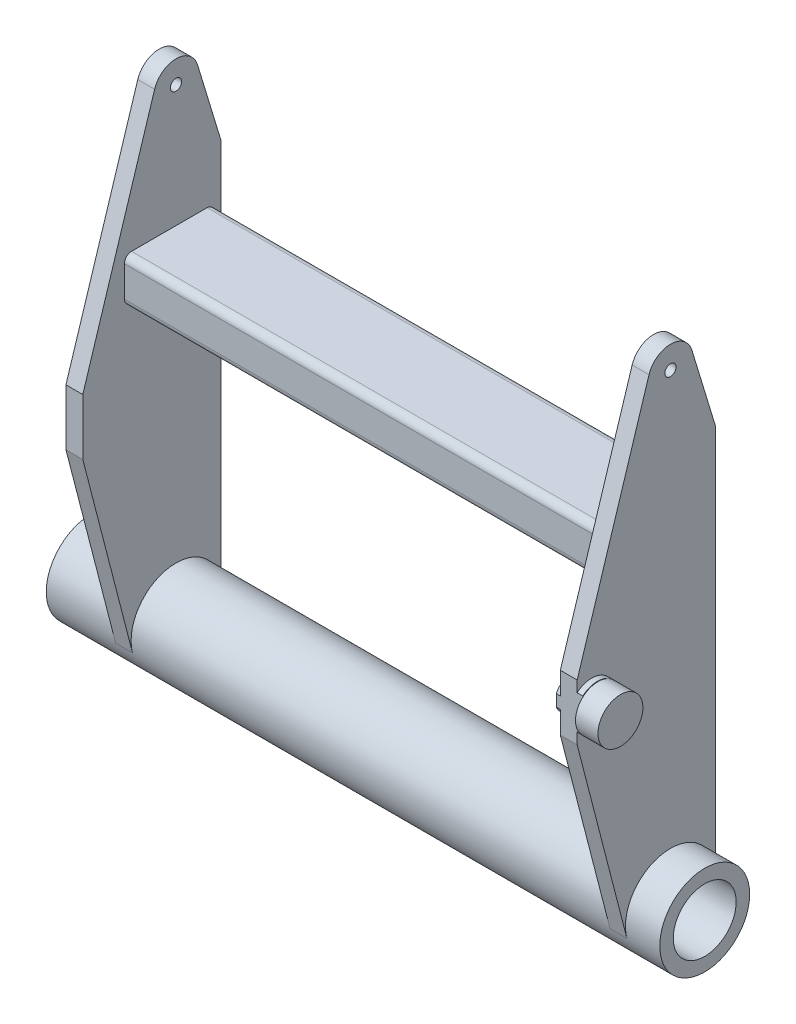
ISO-10303-21;
HEADER;
FILE_DESCRIPTION(('STEP AP214'),'2;1');
FILE_NAME('part.step','',(''),(''),'','','');
FILE_SCHEMA(('AUTOMOTIVE_DESIGN { 1 0 10303 214 1 1 1 1 }'));
ENDSEC;
DATA;
#1=APPLICATION_CONTEXT('core data for automotive mechanical design processes');
#2=APPLICATION_PROTOCOL_DEFINITION('international standard','automotive_design',2000,#1);
#3=PRODUCT_CONTEXT('',#1,'mechanical');
#4=PRODUCT('Part','Part','',(#3));
#5=PRODUCT_RELATED_PRODUCT_CATEGORY('part','',(#4));
#6=PRODUCT_DEFINITION_FORMATION('','',#4);
#7=PRODUCT_DEFINITION_CONTEXT('part definition',#1,'design');
#8=PRODUCT_DEFINITION('design','',#6,#7);
#9=PRODUCT_DEFINITION_SHAPE('','',#8);
#10=(LENGTH_UNIT() NAMED_UNIT(*) SI_UNIT(.MILLI.,.METRE.));
#11=(NAMED_UNIT(*) PLANE_ANGLE_UNIT() SI_UNIT($,.RADIAN.));
#12=(NAMED_UNIT(*) SI_UNIT($,.STERADIAN.) SOLID_ANGLE_UNIT());
#13=UNCERTAINTY_MEASURE_WITH_UNIT(LENGTH_MEASURE(1.E-05),#10,'distance_accuracy_value','');
#14=(GEOMETRIC_REPRESENTATION_CONTEXT(3) GLOBAL_UNCERTAINTY_ASSIGNED_CONTEXT((#13)) GLOBAL_UNIT_ASSIGNED_CONTEXT((#10,
#11,#12)) REPRESENTATION_CONTEXT('',''));
#15=CARTESIAN_POINT('',(0.,0.,0.));
#16=DIRECTION('',(0.,0.,1.));
#17=DIRECTION('',(1.,0.,0.));
#18=AXIS2_PLACEMENT_3D('',#15,#16,#17);
#19=CARTESIAN_POINT('',(253.,186.3,70.));
#20=DIRECTION('',(-1.,0.,0.));
#21=DIRECTION('',(0.,0.,1.));
#22=AXIS2_PLACEMENT_3D('',#19,#20,#21);
#23=CYLINDRICAL_SURFACE('',#22,20.);
#24=DIRECTION('',(-1.,0.,0.));
#25=VECTOR('',#24,1.);
#26=CARTESIAN_POINT('',(253.,172.052196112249,84.0356718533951));
#27=LINE('',#26,#25);
#28=CARTESIAN_POINT('',(253.,172.052196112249,84.0356718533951));
#29=VERTEX_POINT('',#28);
#30=CARTESIAN_POINT('',(233.,172.052196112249,84.0356718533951));
#31=VERTEX_POINT('',#30);
#32=EDGE_CURVE('E11',#29,#31,#27,.T.);
#33=ORIENTED_EDGE('',*,*,#32,.F.);
#34=CARTESIAN_POINT('',(253.,186.3,70.));
#35=DIRECTION('',(1.,0.,0.));
#36=DIRECTION('',(0.,0.,-1.));
#37=AXIS2_PLACEMENT_3D('',#34,#35,#36);
#38=CIRCLE('',#37,20.);
#39=CARTESIAN_POINT('',(253.,172.264328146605,84.247803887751));
#40=VERTEX_POINT('',#39);
#41=EDGE_CURVE('E637',#40,#29,#38,.T.);
#42=ORIENTED_EDGE('',*,*,#41,.F.);
#43=DIRECTION('',(-1.,0.,0.));
#44=VECTOR('',#43,1.);
#45=CARTESIAN_POINT('',(253.,172.264328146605,84.247803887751));
#46=LINE('',#45,#44);
#47=CARTESIAN_POINT('',(233.,172.264328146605,84.247803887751));
#48=VERTEX_POINT('',#47);
#49=EDGE_CURVE('E627',#48,#40,#46,.F.);
#50=ORIENTED_EDGE('',*,*,#49,.F.);
#51=CARTESIAN_POINT('',(233.,186.3,70.));
#52=DIRECTION('',(1.,0.,0.));
#53=DIRECTION('',(0.,0.,-1.));
#54=AXIS2_PLACEMENT_3D('',#51,#52,#53);
#55=CIRCLE('',#54,20.);
#56=EDGE_CURVE('E954',#48,#31,#55,.T.);
#57=ORIENTED_EDGE('',*,*,#56,.T.);
#58=EDGE_LOOP('',(#33,#42,#50,#57));
#59=FACE_BOUND('',#58,.T.);
#60=ADVANCED_FACE('F352',(#59),#23,.T.);
#61=DIRECTION('',(-1.,0.,0.));
#62=VECTOR('',#61,1.);
#63=CARTESIAN_POINT('',(253.,200.335671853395,55.752196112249));
#64=LINE('',#63,#62);
#65=CARTESIAN_POINT('',(233.,200.335671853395,55.752196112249));
#66=VERTEX_POINT('',#65);
#67=CARTESIAN_POINT('',(253.,200.335671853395,55.752196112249));
#68=VERTEX_POINT('',#67);
#69=EDGE_CURVE('E356',#66,#68,#64,.F.);
#70=ORIENTED_EDGE('',*,*,#69,.F.);
#71=CARTESIAN_POINT('',(233.,200.547803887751,55.964328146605));
#72=VERTEX_POINT('',#71);
#73=EDGE_CURVE('E950',#66,#72,#55,.T.);
#74=ORIENTED_EDGE('',*,*,#73,.T.);
#75=DIRECTION('',(-1.,0.,0.));
#76=VECTOR('',#75,1.);
#77=CARTESIAN_POINT('',(253.,200.547803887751,55.964328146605));
#78=LINE('',#77,#76);
#79=CARTESIAN_POINT('',(253.,200.547803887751,55.964328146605));
#80=VERTEX_POINT('',#79);
#81=EDGE_CURVE('E926',#80,#72,#78,.T.);
#82=ORIENTED_EDGE('',*,*,#81,.F.);
#83=EDGE_CURVE('E639',#68,#80,#38,.T.);
#84=ORIENTED_EDGE('',*,*,#83,.F.);
#85=EDGE_LOOP('',(#70,#74,#82,#84));
#86=FACE_BOUND('',#85,.T.);
#87=ADVANCED_FACE('F949',(#86),#23,.T.);
#88=EDGE_CURVE('E946',#29,#68,#38,.T.);
#89=ORIENTED_EDGE('',*,*,#88,.F.);
#90=ORIENTED_EDGE('',*,*,#32,.T.);
#91=EDGE_CURVE('E955',#31,#66,#55,.T.);
#92=ORIENTED_EDGE('',*,*,#91,.T.);
#93=ORIENTED_EDGE('',*,*,#69,.T.);
#94=EDGE_LOOP('',(#89,#90,#92,#93));
#95=FACE_BOUND('',#94,.T.);
#96=ADVANCED_FACE('F956',(#95),#23,.T.);
#97=CARTESIAN_POINT('',(212.5,0.,0.));
#98=DIRECTION('',(1.,0.,0.));
#99=DIRECTION('',(0.,0.,-1.));
#100=AXIS2_PLACEMENT_3D('',#97,#98,#99);
#101=PLANE('',#100);
#102=CARTESIAN_POINT('',(212.5,408.6,0.));
#103=DIRECTION('',(1.,0.,0.));
#104=DIRECTION('',(0.,0.,-1.));
#105=AXIS2_PLACEMENT_3D('',#102,#103,#104);
#106=CIRCLE('',#105,5.);
#107=CARTESIAN_POINT('',(212.5,408.6,-5.));
#108=VERTEX_POINT('',#107);
#109=EDGE_CURVE('E648',#108,#108,#106,.T.);
#110=ORIENTED_EDGE('',*,*,#109,.T.);
#111=EDGE_LOOP('',(#110));
#112=FACE_BOUND('',#111,.T.);
#113=CARTESIAN_POINT('',(212.5,293.6,-27.6));
#114=DIRECTION('',(-1.,0.,0.));
#115=DIRECTION('',(0.,0.,-1.));
#116=AXIS2_PLACEMENT_3D('',#113,#114,#115);
#117=CIRCLE('',#116,6.39999999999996);
#118=CARTESIAN_POINT('',(212.5,300.,-27.6));
#119=VERTEX_POINT('',#118);
#120=CARTESIAN_POINT('',(212.5,293.6,-34.));
#121=VERTEX_POINT('',#120);
#122=EDGE_CURVE('E799',#119,#121,#117,.T.);
#123=ORIENTED_EDGE('',*,*,#122,.F.);
#124=DIRECTION('',(0.,0.,-1.));
#125=VECTOR('',#124,1.);
#126=CARTESIAN_POINT('',(212.5,300.,-27.6));
#127=LINE('',#126,#125);
#128=CARTESIAN_POINT('',(212.5,300.,39.6));
#129=VERTEX_POINT('',#128);
#130=EDGE_CURVE('E820',#129,#119,#127,.T.);
#131=ORIENTED_EDGE('',*,*,#130,.F.);
#132=CARTESIAN_POINT('',(212.5,293.6,39.6));
#133=DIRECTION('',(-1.,0.,0.));
#134=DIRECTION('',(0.,0.,-1.));
#135=AXIS2_PLACEMENT_3D('',#132,#133,#134);
#136=CIRCLE('',#135,6.40000000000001);
#137=CARTESIAN_POINT('',(212.5,293.6,46.));
#138=VERTEX_POINT('',#137);
#139=EDGE_CURVE('E817',#138,#129,#136,.T.);
#140=ORIENTED_EDGE('',*,*,#139,.F.);
#141=DIRECTION('',(0.,1.,0.));
#142=VECTOR('',#141,1.);
#143=CARTESIAN_POINT('',(212.5,293.6,46.));
#144=LINE('',#143,#142);
#145=CARTESIAN_POINT('',(212.5,266.4,46.));
#146=VERTEX_POINT('',#145);
#147=EDGE_CURVE('E814',#146,#138,#144,.T.);
#148=ORIENTED_EDGE('',*,*,#147,.F.);
#149=CARTESIAN_POINT('',(212.5,266.4,39.6));
#150=DIRECTION('',(-1.,0.,0.));
#151=DIRECTION('',(0.,0.,-1.));
#152=AXIS2_PLACEMENT_3D('',#149,#150,#151);
#153=CIRCLE('',#152,6.39999999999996);
#154=CARTESIAN_POINT('',(212.5,260.,39.6));
#155=VERTEX_POINT('',#154);
#156=EDGE_CURVE('E811',#155,#146,#153,.T.);
#157=ORIENTED_EDGE('',*,*,#156,.F.);
#158=DIRECTION('',(0.,0.,1.));
#159=VECTOR('',#158,1.);
#160=CARTESIAN_POINT('',(212.5,260.,-27.6));
#161=LINE('',#160,#159);
#162=CARTESIAN_POINT('',(212.5,260.,-27.6));
#163=VERTEX_POINT('',#162);
#164=EDGE_CURVE('E808',#163,#155,#161,.T.);
#165=ORIENTED_EDGE('',*,*,#164,.F.);
#166=CARTESIAN_POINT('',(212.5,266.4,-27.6));
#167=DIRECTION('',(-1.,0.,0.));
#168=DIRECTION('',(0.,0.,-1.));
#169=AXIS2_PLACEMENT_3D('',#166,#167,#168);
#170=CIRCLE('',#169,6.39999999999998);
#171=CARTESIAN_POINT('',(212.5,266.4,-34.));
#172=VERTEX_POINT('',#171);
#173=EDGE_CURVE('E805',#172,#163,#170,.T.);
#174=ORIENTED_EDGE('',*,*,#173,.F.);
#175=DIRECTION('',(0.,-1.,0.));
#176=VECTOR('',#175,1.);
#177=CARTESIAN_POINT('',(212.5,293.6,-34.));
#178=LINE('',#177,#176);
#179=EDGE_CURVE('E802',#121,#172,#178,.T.);
#180=ORIENTED_EDGE('',*,*,#179,.F.);
#181=EDGE_LOOP('',(#123,#131,#140,#148,#157,#165,#174,#180));
#182=FACE_BOUND('',#181,.T.);
#183=CARTESIAN_POINT('',(212.5,186.3,70.));
#184=DIRECTION('',(-1.,0.,0.));
#185=DIRECTION('',(0.,0.,1.));
#186=AXIS2_PLACEMENT_3D('',#183,#184,#185);
#187=CIRCLE('',#186,14.);
#188=CARTESIAN_POINT('',(212.5,191.496152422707,83.));
#189=VERTEX_POINT('',#188);
#190=CARTESIAN_POINT('',(212.5,181.103847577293,83.));
#191=VERTEX_POINT('',#190);
#192=EDGE_CURVE('E651',#189,#191,#187,.T.);
#193=ORIENTED_EDGE('',*,*,#192,.F.);
#194=DIRECTION('',(0.,-1.,0.));
#195=VECTOR('',#194,1.);
#196=CARTESIAN_POINT('',(212.5,161.3,83.));
#197=LINE('',#196,#195);
#198=CARTESIAN_POINT('',(212.5,211.3,83.));
#199=VERTEX_POINT('',#198);
#200=EDGE_CURVE('E883',#199,#189,#197,.T.);
#201=ORIENTED_EDGE('',*,*,#200,.F.);
#202=DIRECTION('',(0.,-0.953957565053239,0.299941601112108));
#203=VECTOR('',#202,1.);
#204=CARTESIAN_POINT('',(212.5,211.3,83.));
#205=LINE('',#204,#203);
#206=CARTESIAN_POINT('',(212.5,414.598832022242,19.0791513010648));
#207=VERTEX_POINT('',#206);
#208=EDGE_CURVE('E880',#207,#199,#205,.T.);
#209=ORIENTED_EDGE('',*,*,#208,.F.);
#210=CARTESIAN_POINT('',(212.5,408.6,0.));
#211=DIRECTION('',(1.,0.,0.));
#212=DIRECTION('',(0.,0.,-1.));
#213=AXIS2_PLACEMENT_3D('',#210,#211,#212);
#214=CIRCLE('',#213,20.);
#215=CARTESIAN_POINT('',(212.5,414.414043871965,-19.1362716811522));
#216=VERTEX_POINT('',#215);
#217=EDGE_CURVE('E878',#216,#207,#214,.T.);
#218=ORIENTED_EDGE('',*,*,#217,.F.);
#219=DIRECTION('',(0.,0.956813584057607,0.290702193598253));
#220=VECTOR('',#219,1.);
#221=CARTESIAN_POINT('',(212.5,345.743428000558,-40.));
#222=LINE('',#221,#220);
#223=CARTESIAN_POINT('',(212.5,345.743428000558,-40.));
#224=VERTEX_POINT('',#223);
#225=EDGE_CURVE('E876',#224,#216,#222,.T.);
#226=ORIENTED_EDGE('',*,*,#225,.F.);
#227=DIRECTION('',(0.,1.,0.));
#228=VECTOR('',#227,1.);
#229=CARTESIAN_POINT('',(212.5,0.,-40.));
#230=LINE('',#229,#228);
#231=CARTESIAN_POINT('',(212.5,0.,-40.));
#232=VERTEX_POINT('',#231);
#233=EDGE_CURVE('E874',#232,#224,#230,.T.);
#234=ORIENTED_EDGE('',*,*,#233,.F.);
#235=CARTESIAN_POINT('',(212.5,0.,0.));
#236=DIRECTION('',(-1.,0.,0.));
#237=DIRECTION('',(0.,0.,-1.));
#238=AXIS2_PLACEMENT_3D('',#235,#236,#237);
#239=CIRCLE('',#238,40.);
#240=CARTESIAN_POINT('',(212.5,-10.0086252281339,38.727605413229));
#241=VERTEX_POINT('',#240);
#242=EDGE_CURVE('E871',#241,#232,#239,.T.);
#243=ORIENTED_EDGE('',*,*,#242,.F.);
#244=DIRECTION('',(0.,-0.968190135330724,-0.250215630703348));
#245=VECTOR('',#244,1.);
#246=CARTESIAN_POINT('',(212.5,-10.0086252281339,38.727605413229));
#247=LINE('',#246,#245);
#248=CARTESIAN_POINT('',(212.5,161.3,83.));
#249=VERTEX_POINT('',#248);
#250=EDGE_CURVE('E885',#249,#241,#247,.T.);
#251=ORIENTED_EDGE('',*,*,#250,.F.);
#252=EDGE_CURVE('E882',#191,#249,#197,.T.);
#253=ORIENTED_EDGE('',*,*,#252,.F.);
#254=EDGE_LOOP('',(#193,#201,#209,#218,#226,#234,#243,#251,#253));
#255=FACE_BOUND('',#254,.T.);
#256=ADVANCED_FACE('F963',(#112,#182,#255),#101,.F.);
#257=CARTESIAN_POINT('',(227.5,0.,0.));
#258=DIRECTION('',(1.,0.,0.));
#259=DIRECTION('',(0.,0.,-1.));
#260=AXIS2_PLACEMENT_3D('',#257,#258,#259);
#261=PLANE('',#260);
#262=CARTESIAN_POINT('',(227.5,408.6,0.));
#263=DIRECTION('',(1.,0.,0.));
#264=DIRECTION('',(0.,0.,-1.));
#265=AXIS2_PLACEMENT_3D('',#262,#263,#264);
#266=CIRCLE('',#265,5.);
#267=CARTESIAN_POINT('',(227.5,408.6,-5.));
#268=VERTEX_POINT('',#267);
#269=EDGE_CURVE('E634',#268,#268,#266,.T.);
#270=ORIENTED_EDGE('',*,*,#269,.F.);
#271=EDGE_LOOP('',(#270));
#272=FACE_BOUND('',#271,.T.);
#273=DIRECTION('',(0.,-1.,0.));
#274=VECTOR('',#273,1.);
#275=CARTESIAN_POINT('',(227.5,161.3,83.));
#276=LINE('',#275,#274);
#277=CARTESIAN_POINT('',(227.5,211.3,83.));
#278=VERTEX_POINT('',#277);
#279=CARTESIAN_POINT('',(227.5,201.498684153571,83.));
#280=VERTEX_POINT('',#279);
#281=EDGE_CURVE('E900',#278,#280,#276,.T.);
#282=ORIENTED_EDGE('',*,*,#281,.T.);
#283=CARTESIAN_POINT('',(227.5,186.3,70.));
#284=DIRECTION('',(1.,0.,0.));
#285=DIRECTION('',(0.,0.,-1.));
#286=AXIS2_PLACEMENT_3D('',#283,#284,#285);
#287=CIRCLE('',#286,20.);
#288=CARTESIAN_POINT('',(227.5,171.101315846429,83.));
#289=VERTEX_POINT('',#288);
#290=EDGE_CURVE('E663',#289,#280,#287,.T.);
#291=ORIENTED_EDGE('',*,*,#290,.F.);
#292=CARTESIAN_POINT('',(227.5,161.3,83.));
#293=VERTEX_POINT('',#292);
#294=EDGE_CURVE('E899',#289,#293,#276,.T.);
#295=ORIENTED_EDGE('',*,*,#294,.T.);
#296=DIRECTION('',(0.,-0.968190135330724,-0.250215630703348));
#297=VECTOR('',#296,1.);
#298=CARTESIAN_POINT('',(227.5,-10.0086252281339,38.727605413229));
#299=LINE('',#298,#297);
#300=CARTESIAN_POINT('',(227.5,-10.0086252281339,38.727605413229));
#301=VERTEX_POINT('',#300);
#302=EDGE_CURVE('E902',#293,#301,#299,.T.);
#303=ORIENTED_EDGE('',*,*,#302,.T.);
#304=CARTESIAN_POINT('',(227.5,0.,0.));
#305=DIRECTION('',(-1.,0.,0.));
#306=DIRECTION('',(0.,0.,-1.));
#307=AXIS2_PLACEMENT_3D('',#304,#305,#306);
#308=CIRCLE('',#307,40.);
#309=CARTESIAN_POINT('',(227.5,0.,-40.));
#310=VERTEX_POINT('',#309);
#311=EDGE_CURVE('E888',#301,#310,#308,.T.);
#312=ORIENTED_EDGE('',*,*,#311,.T.);
#313=DIRECTION('',(0.,1.,0.));
#314=VECTOR('',#313,1.);
#315=CARTESIAN_POINT('',(227.5,0.,-40.));
#316=LINE('',#315,#314);
#317=CARTESIAN_POINT('',(227.5,345.743428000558,-40.));
#318=VERTEX_POINT('',#317);
#319=EDGE_CURVE('E891',#310,#318,#316,.T.);
#320=ORIENTED_EDGE('',*,*,#319,.T.);
#321=DIRECTION('',(0.,0.956813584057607,0.290702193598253));
#322=VECTOR('',#321,1.);
#323=CARTESIAN_POINT('',(227.5,345.743428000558,-40.));
#324=LINE('',#323,#322);
#325=CARTESIAN_POINT('',(227.5,414.414043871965,-19.1362716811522));
#326=VERTEX_POINT('',#325);
#327=EDGE_CURVE('E893',#318,#326,#324,.T.);
#328=ORIENTED_EDGE('',*,*,#327,.T.);
#329=CARTESIAN_POINT('',(227.5,408.6,0.));
#330=DIRECTION('',(1.,0.,0.));
#331=DIRECTION('',(0.,0.,-1.));
#332=AXIS2_PLACEMENT_3D('',#329,#330,#331);
#333=CIRCLE('',#332,20.);
#334=CARTESIAN_POINT('',(227.5,414.598832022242,19.0791513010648));
#335=VERTEX_POINT('',#334);
#336=EDGE_CURVE('E895',#326,#335,#333,.T.);
#337=ORIENTED_EDGE('',*,*,#336,.T.);
#338=DIRECTION('',(0.,-0.953957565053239,0.299941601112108));
#339=VECTOR('',#338,1.);
#340=CARTESIAN_POINT('',(227.5,211.3,83.));
#341=LINE('',#340,#339);
#342=EDGE_CURVE('E897',#335,#278,#341,.T.);
#343=ORIENTED_EDGE('',*,*,#342,.T.);
#344=EDGE_LOOP('',(#282,#291,#295,#303,#312,#320,#328,#337,#343));
#345=FACE_BOUND('',#344,.T.);
#346=ADVANCED_FACE('F968',(#272,#345),#261,.T.);
#347=CARTESIAN_POINT('',(227.5,0.,-40.));
#348=DIRECTION('',(0.,0.,1.));
#349=DIRECTION('',(0.,-1.,0.));
#350=AXIS2_PLACEMENT_3D('',#347,#348,#349);
#351=PLANE('',#350);
#352=ORIENTED_EDGE('',*,*,#233,.T.);
#353=DIRECTION('',(-1.,0.,0.));
#354=VECTOR('',#353,1.);
#355=CARTESIAN_POINT('',(227.5,345.743428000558,-40.));
#356=LINE('',#355,#354);
#357=EDGE_CURVE('E919',#318,#224,#356,.T.);
#358=ORIENTED_EDGE('',*,*,#357,.F.);
#359=ORIENTED_EDGE('',*,*,#319,.F.);
#360=DIRECTION('',(-1.,0.,0.));
#361=VECTOR('',#360,1.);
#362=CARTESIAN_POINT('',(227.5,0.,-40.));
#363=LINE('',#362,#361);
#364=EDGE_CURVE('E628',#310,#232,#363,.T.);
#365=ORIENTED_EDGE('',*,*,#364,.T.);
#366=EDGE_LOOP('',(#352,#358,#359,#365));
#367=FACE_BOUND('',#366,.T.);
#368=ADVANCED_FACE('F354',(#367),#351,.F.);
#369=CARTESIAN_POINT('',(227.5,345.743428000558,-40.));
#370=DIRECTION('',(0.,-0.290702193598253,0.956813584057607));
#371=DIRECTION('',(0.,-0.956813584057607,-0.290702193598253));
#372=AXIS2_PLACEMENT_3D('',#369,#370,#371);
#373=PLANE('',#372);
#374=ORIENTED_EDGE('',*,*,#225,.T.);
#375=DIRECTION('',(-1.,0.,0.));
#376=VECTOR('',#375,1.);
#377=CARTESIAN_POINT('',(227.5,414.414043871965,-19.1362716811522));
#378=LINE('',#377,#376);
#379=EDGE_CURVE('E916',#326,#216,#378,.T.);
#380=ORIENTED_EDGE('',*,*,#379,.F.);
#381=ORIENTED_EDGE('',*,*,#327,.F.);
#382=ORIENTED_EDGE('',*,*,#357,.T.);
#383=EDGE_LOOP('',(#374,#380,#381,#382));
#384=FACE_BOUND('',#383,.T.);
#385=ADVANCED_FACE('F1279',(#384),#373,.F.);
#386=CARTESIAN_POINT('',(227.5,408.6,0.));
#387=DIRECTION('',(-1.,0.,0.));
#388=DIRECTION('',(0.,0.,1.));
#389=AXIS2_PLACEMENT_3D('',#386,#387,#388);
#390=CYLINDRICAL_SURFACE('',#389,20.);
#391=ORIENTED_EDGE('',*,*,#217,.T.);
#392=DIRECTION('',(-1.,0.,0.));
#393=VECTOR('',#392,1.);
#394=CARTESIAN_POINT('',(227.5,414.598832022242,19.0791513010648));
#395=LINE('',#394,#393);
#396=EDGE_CURVE('E913',#335,#207,#395,.T.);
#397=ORIENTED_EDGE('',*,*,#396,.F.);
#398=ORIENTED_EDGE('',*,*,#336,.F.);
#399=ORIENTED_EDGE('',*,*,#379,.T.);
#400=EDGE_LOOP('',(#391,#397,#398,#399));
#401=FACE_BOUND('',#400,.T.);
#402=ADVANCED_FACE('F1276',(#401),#390,.T.);
#403=CARTESIAN_POINT('',(227.5,211.3,83.));
#404=DIRECTION('',(0.,-0.299941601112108,-0.953957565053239));
#405=DIRECTION('',(0.,0.953957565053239,-0.299941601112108));
#406=AXIS2_PLACEMENT_3D('',#403,#404,#405);
#407=PLANE('',#406);
#408=ORIENTED_EDGE('',*,*,#208,.T.);
#409=DIRECTION('',(-1.,0.,0.));
#410=VECTOR('',#409,1.);
#411=CARTESIAN_POINT('',(227.5,211.3,83.));
#412=LINE('',#411,#410);
#413=EDGE_CURVE('E910',#278,#199,#412,.T.);
#414=ORIENTED_EDGE('',*,*,#413,.F.);
#415=ORIENTED_EDGE('',*,*,#342,.F.);
#416=ORIENTED_EDGE('',*,*,#396,.T.);
#417=EDGE_LOOP('',(#408,#414,#415,#416));
#418=FACE_BOUND('',#417,.T.);
#419=ADVANCED_FACE('F1177',(#418),#407,.F.);
#420=CARTESIAN_POINT('',(227.5,161.3,83.));
#421=DIRECTION('',(0.,0.,-1.));
#422=DIRECTION('',(-1.,0.,0.));
#423=AXIS2_PLACEMENT_3D('',#420,#421,#422);
#424=PLANE('',#423);
#425=ORIENTED_EDGE('',*,*,#200,.T.);
#426=DIRECTION('',(1.,0.,0.));
#427=VECTOR('',#426,1.);
#428=CARTESIAN_POINT('',(209.,191.496152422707,83.));
#429=LINE('',#428,#427);
#430=CARTESIAN_POINT('',(209.,191.496152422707,83.));
#431=VERTEX_POINT('',#430);
#432=EDGE_CURVE('E658',#431,#189,#429,.T.);
#433=ORIENTED_EDGE('',*,*,#432,.F.);
#434=DIRECTION('',(0.,1.,0.));
#435=VECTOR('',#434,1.);
#436=CARTESIAN_POINT('',(209.,191.496152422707,83.));
#437=LINE('',#436,#435);
#438=CARTESIAN_POINT('',(209.,181.103847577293,83.));
#439=VERTEX_POINT('',#438);
#440=EDGE_CURVE('E656',#439,#431,#437,.T.);
#441=ORIENTED_EDGE('',*,*,#440,.F.);
#442=DIRECTION('',(1.,0.,0.));
#443=VECTOR('',#442,1.);
#444=CARTESIAN_POINT('',(209.,181.103847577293,83.));
#445=LINE('',#444,#443);
#446=EDGE_CURVE('E660',#439,#191,#445,.T.);
#447=ORIENTED_EDGE('',*,*,#446,.T.);
#448=ORIENTED_EDGE('',*,*,#252,.T.);
#449=DIRECTION('',(-1.,0.,0.));
#450=VECTOR('',#449,1.);
#451=CARTESIAN_POINT('',(227.5,161.3,83.));
#452=LINE('',#451,#450);
#453=EDGE_CURVE('E907',#293,#249,#452,.T.);
#454=ORIENTED_EDGE('',*,*,#453,.F.);
#455=ORIENTED_EDGE('',*,*,#294,.F.);
#456=DIRECTION('',(-1.,0.,0.));
#457=VECTOR('',#456,1.);
#458=CARTESIAN_POINT('',(232.5,171.101315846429,83.));
#459=LINE('',#458,#457);
#460=CARTESIAN_POINT('',(232.5,171.101315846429,83.));
#461=VERTEX_POINT('',#460);
#462=EDGE_CURVE('E613',#461,#289,#459,.T.);
#463=ORIENTED_EDGE('',*,*,#462,.F.);
#464=DIRECTION('',(0.,-1.,0.));
#465=VECTOR('',#464,1.);
#466=CARTESIAN_POINT('',(232.5,201.498684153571,83.));
#467=LINE('',#466,#465);
#468=CARTESIAN_POINT('',(232.5,178.816685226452,83.));
#469=VERTEX_POINT('',#468);
#470=EDGE_CURVE('E616',#469,#461,#467,.T.);
#471=ORIENTED_EDGE('',*,*,#470,.F.);
#472=CARTESIAN_POINT('',(232.5,193.783314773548,83.));
#473=VERTEX_POINT('',#472);
#474=EDGE_CURVE('E614',#473,#469,#467,.T.);
#475=ORIENTED_EDGE('',*,*,#474,.F.);
#476=CARTESIAN_POINT('',(232.5,201.498684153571,83.));
#477=VERTEX_POINT('',#476);
#478=EDGE_CURVE('E602',#477,#473,#467,.T.);
#479=ORIENTED_EDGE('',*,*,#478,.F.);
#480=DIRECTION('',(-1.,0.,0.));
#481=VECTOR('',#480,1.);
#482=CARTESIAN_POINT('',(232.5,201.498684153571,83.));
#483=LINE('',#482,#481);
#484=EDGE_CURVE('E669',#477,#280,#483,.T.);
#485=ORIENTED_EDGE('',*,*,#484,.T.);
#486=ORIENTED_EDGE('',*,*,#281,.F.);
#487=ORIENTED_EDGE('',*,*,#413,.T.);
#488=EDGE_LOOP('',(#425,#433,#441,#447,#448,#454,#455,#463,#471,#475,#479,#485,#486,#487));
#489=FACE_BOUND('',#488,.T.);
#490=ADVANCED_FACE('F619',(#489),#424,.F.);
#491=CARTESIAN_POINT('',(227.5,-10.0086252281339,38.727605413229));
#492=DIRECTION('',(0.,0.250215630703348,-0.968190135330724));
#493=DIRECTION('',(0.,0.968190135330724,0.250215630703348));
#494=AXIS2_PLACEMENT_3D('',#491,#492,#493);
#495=PLANE('',#494);
#496=ORIENTED_EDGE('',*,*,#250,.T.);
#497=DIRECTION('',(-1.,0.,0.));
#498=VECTOR('',#497,1.);
#499=CARTESIAN_POINT('',(227.5,-10.0086252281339,38.727605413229));
#500=LINE('',#499,#498);
#501=EDGE_CURVE('E904',#301,#241,#500,.T.);
#502=ORIENTED_EDGE('',*,*,#501,.F.);
#503=ORIENTED_EDGE('',*,*,#302,.F.);
#504=ORIENTED_EDGE('',*,*,#453,.T.);
#505=EDGE_LOOP('',(#496,#502,#503,#504));
#506=FACE_BOUND('',#505,.T.);
#507=ADVANCED_FACE('F1176',(#506),#495,.F.);
#508=CARTESIAN_POINT('',(-212.5,293.6,-27.6));
#509=DIRECTION('',(1.,0.,0.));
#510=DIRECTION('',(0.,0.,-1.));
#511=AXIS2_PLACEMENT_3D('',#508,#509,#510);
#512=CYLINDRICAL_SURFACE('',#511,6.39999999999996);
#513=ORIENTED_EDGE('',*,*,#122,.T.);
#514=DIRECTION('',(1.,0.,0.));
#515=VECTOR('',#514,1.);
#516=CARTESIAN_POINT('',(-212.5,293.6,-34.));
#517=LINE('',#516,#515);
#518=CARTESIAN_POINT('',(-212.5,293.6,-34.));
#519=VERTEX_POINT('',#518);
#520=EDGE_CURVE('E868',#519,#121,#517,.T.);
#521=ORIENTED_EDGE('',*,*,#520,.F.);
#522=CARTESIAN_POINT('',(-212.5,293.6,-27.6));
#523=DIRECTION('',(-1.,0.,0.));
#524=DIRECTION('',(0.,0.,-1.));
#525=AXIS2_PLACEMENT_3D('',#522,#523,#524);
#526=CIRCLE('',#525,6.39999999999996);
#527=CARTESIAN_POINT('',(-212.5,300.,-27.6));
#528=VERTEX_POINT('',#527);
#529=EDGE_CURVE('E823',#528,#519,#526,.T.);
#530=ORIENTED_EDGE('',*,*,#529,.F.);
#531=DIRECTION('',(1.,0.,0.));
#532=VECTOR('',#531,1.);
#533=CARTESIAN_POINT('',(-212.5,300.,-27.6));
#534=LINE('',#533,#532);
#535=EDGE_CURVE('E847',#528,#119,#534,.T.);
#536=ORIENTED_EDGE('',*,*,#535,.T.);
#537=EDGE_LOOP('',(#513,#521,#530,#536));
#538=FACE_BOUND('',#537,.T.);
#539=ADVANCED_FACE('F1268',(#538),#512,.T.);
#540=CARTESIAN_POINT('',(-212.5,293.6,-34.));
#541=DIRECTION('',(0.,0.,1.));
#542=DIRECTION('',(0.,-1.,0.));
#543=AXIS2_PLACEMENT_3D('',#540,#541,#542);
#544=PLANE('',#543);
#545=ORIENTED_EDGE('',*,*,#179,.T.);
#546=DIRECTION('',(1.,0.,0.));
#547=VECTOR('',#546,1.);
#548=CARTESIAN_POINT('',(-212.5,266.4,-34.));
#549=LINE('',#548,#547);
#550=CARTESIAN_POINT('',(-212.5,266.4,-34.));
#551=VERTEX_POINT('',#550);
#552=EDGE_CURVE('E865',#551,#172,#549,.T.);
#553=ORIENTED_EDGE('',*,*,#552,.F.);
#554=DIRECTION('',(0.,-1.,0.));
#555=VECTOR('',#554,1.);
#556=CARTESIAN_POINT('',(-212.5,293.6,-34.));
#557=LINE('',#556,#555);
#558=EDGE_CURVE('E826',#519,#551,#557,.T.);
#559=ORIENTED_EDGE('',*,*,#558,.F.);
#560=ORIENTED_EDGE('',*,*,#520,.T.);
#561=EDGE_LOOP('',(#545,#553,#559,#560));
#562=FACE_BOUND('',#561,.T.);
#563=ADVANCED_FACE('F1264',(#562),#544,.F.);
#564=CARTESIAN_POINT('',(-212.5,266.4,-27.6));
#565=DIRECTION('',(1.,0.,0.));
#566=DIRECTION('',(0.,0.,-1.));
#567=AXIS2_PLACEMENT_3D('',#564,#565,#566);
#568=CYLINDRICAL_SURFACE('',#567,6.39999999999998);
#569=ORIENTED_EDGE('',*,*,#173,.T.);
#570=DIRECTION('',(1.,0.,0.));
#571=VECTOR('',#570,1.);
#572=CARTESIAN_POINT('',(-212.5,260.,-27.6));
#573=LINE('',#572,#571);
#574=CARTESIAN_POINT('',(-212.5,260.,-27.6));
#575=VERTEX_POINT('',#574);
#576=EDGE_CURVE('E862',#575,#163,#573,.T.);
#577=ORIENTED_EDGE('',*,*,#576,.F.);
#578=CARTESIAN_POINT('',(-212.5,266.4,-27.6));
#579=DIRECTION('',(-1.,0.,0.));
#580=DIRECTION('',(0.,0.,-1.));
#581=AXIS2_PLACEMENT_3D('',#578,#579,#580);
#582=CIRCLE('',#581,6.39999999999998);
#583=EDGE_CURVE('E829',#551,#575,#582,.T.);
#584=ORIENTED_EDGE('',*,*,#583,.F.);
#585=ORIENTED_EDGE('',*,*,#552,.T.);
#586=EDGE_LOOP('',(#569,#577,#584,#585));
#587=FACE_BOUND('',#586,.T.);
#588=ADVANCED_FACE('F1260',(#587),#568,.T.);
#589=CARTESIAN_POINT('',(-212.5,260.,-27.6));
#590=DIRECTION('',(0.,1.,0.));
#591=DIRECTION('',(0.,0.,1.));
#592=AXIS2_PLACEMENT_3D('',#589,#590,#591);
#593=PLANE('',#592);
#594=ORIENTED_EDGE('',*,*,#164,.T.);
#595=DIRECTION('',(1.,0.,0.));
#596=VECTOR('',#595,1.);
#597=CARTESIAN_POINT('',(-212.5,260.,39.6));
#598=LINE('',#597,#596);
#599=CARTESIAN_POINT('',(-212.5,260.,39.6));
#600=VERTEX_POINT('',#599);
#601=EDGE_CURVE('E859',#600,#155,#598,.T.);
#602=ORIENTED_EDGE('',*,*,#601,.F.);
#603=DIRECTION('',(0.,0.,1.));
#604=VECTOR('',#603,1.);
#605=CARTESIAN_POINT('',(-212.5,260.,-27.6));
#606=LINE('',#605,#604);
#607=EDGE_CURVE('E832',#575,#600,#606,.T.);
#608=ORIENTED_EDGE('',*,*,#607,.F.);
#609=ORIENTED_EDGE('',*,*,#576,.T.);
#610=EDGE_LOOP('',(#594,#602,#608,#609));
#611=FACE_BOUND('',#610,.T.);
#612=ADVANCED_FACE('F1256',(#611),#593,.F.);
#613=CARTESIAN_POINT('',(-212.5,266.4,39.6));
#614=DIRECTION('',(1.,0.,0.));
#615=DIRECTION('',(0.,0.,-1.));
#616=AXIS2_PLACEMENT_3D('',#613,#614,#615);
#617=CYLINDRICAL_SURFACE('',#616,6.39999999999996);
#618=ORIENTED_EDGE('',*,*,#156,.T.);
#619=DIRECTION('',(1.,0.,0.));
#620=VECTOR('',#619,1.);
#621=CARTESIAN_POINT('',(-212.5,266.4,46.));
#622=LINE('',#621,#620);
#623=CARTESIAN_POINT('',(-212.5,266.4,46.));
#624=VERTEX_POINT('',#623);
#625=EDGE_CURVE('E856',#624,#146,#622,.T.);
#626=ORIENTED_EDGE('',*,*,#625,.F.);
#627=CARTESIAN_POINT('',(-212.5,266.4,39.6));
#628=DIRECTION('',(-1.,0.,0.));
#629=DIRECTION('',(0.,0.,-1.));
#630=AXIS2_PLACEMENT_3D('',#627,#628,#629);
#631=CIRCLE('',#630,6.39999999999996);
#632=EDGE_CURVE('E835',#600,#624,#631,.T.);
#633=ORIENTED_EDGE('',*,*,#632,.F.);
#634=ORIENTED_EDGE('',*,*,#601,.T.);
#635=EDGE_LOOP('',(#618,#626,#633,#634));
#636=FACE_BOUND('',#635,.T.);
#637=ADVANCED_FACE('F1252',(#636),#617,.T.);
#638=CARTESIAN_POINT('',(-212.5,293.6,46.));
#639=DIRECTION('',(0.,0.,-1.));
#640=DIRECTION('',(0.,1.,0.));
#641=AXIS2_PLACEMENT_3D('',#638,#639,#640);
#642=PLANE('',#641);
#643=ORIENTED_EDGE('',*,*,#147,.T.);
#644=DIRECTION('',(1.,0.,0.));
#645=VECTOR('',#644,1.);
#646=CARTESIAN_POINT('',(-212.5,293.6,46.));
#647=LINE('',#646,#645);
#648=CARTESIAN_POINT('',(-212.5,293.6,46.));
#649=VERTEX_POINT('',#648);
#650=EDGE_CURVE('E853',#649,#138,#647,.T.);
#651=ORIENTED_EDGE('',*,*,#650,.F.);
#652=DIRECTION('',(0.,1.,0.));
#653=VECTOR('',#652,1.);
#654=CARTESIAN_POINT('',(-212.5,293.6,46.));
#655=LINE('',#654,#653);
#656=EDGE_CURVE('E838',#624,#649,#655,.T.);
#657=ORIENTED_EDGE('',*,*,#656,.F.);
#658=ORIENTED_EDGE('',*,*,#625,.T.);
#659=EDGE_LOOP('',(#643,#651,#657,#658));
#660=FACE_BOUND('',#659,.T.);
#661=ADVANCED_FACE('F1248',(#660),#642,.F.);
#662=CARTESIAN_POINT('',(-212.5,293.6,39.6));
#663=DIRECTION('',(1.,0.,0.));
#664=DIRECTION('',(0.,0.,-1.));
#665=AXIS2_PLACEMENT_3D('',#662,#663,#664);
#666=CYLINDRICAL_SURFACE('',#665,6.40000000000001);
#667=ORIENTED_EDGE('',*,*,#139,.T.);
#668=DIRECTION('',(1.,0.,0.));
#669=VECTOR('',#668,1.);
#670=CARTESIAN_POINT('',(-212.5,300.,39.6));
#671=LINE('',#670,#669);
#672=CARTESIAN_POINT('',(-212.5,300.,39.6));
#673=VERTEX_POINT('',#672);
#674=EDGE_CURVE('E850',#673,#129,#671,.T.);
#675=ORIENTED_EDGE('',*,*,#674,.F.);
#676=CARTESIAN_POINT('',(-212.5,293.6,39.6));
#677=DIRECTION('',(-1.,0.,0.));
#678=DIRECTION('',(0.,0.,-1.));
#679=AXIS2_PLACEMENT_3D('',#676,#677,#678);
#680=CIRCLE('',#679,6.40000000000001);
#681=EDGE_CURVE('E841',#649,#673,#680,.T.);
#682=ORIENTED_EDGE('',*,*,#681,.F.);
#683=ORIENTED_EDGE('',*,*,#650,.T.);
#684=EDGE_LOOP('',(#667,#675,#682,#683));
#685=FACE_BOUND('',#684,.T.);
#686=ADVANCED_FACE('F1244',(#685),#666,.T.);
#687=CARTESIAN_POINT('',(-212.5,300.,-27.6));
#688=DIRECTION('',(0.,-1.,0.));
#689=DIRECTION('',(0.,0.,-1.));
#690=AXIS2_PLACEMENT_3D('',#687,#688,#689);
#691=PLANE('',#690);
#692=ORIENTED_EDGE('',*,*,#130,.T.);
#693=ORIENTED_EDGE('',*,*,#535,.F.);
#694=DIRECTION('',(0.,0.,-1.));
#695=VECTOR('',#694,1.);
#696=CARTESIAN_POINT('',(-212.5,300.,-27.6));
#697=LINE('',#696,#695);
#698=EDGE_CURVE('E844',#673,#528,#697,.T.);
#699=ORIENTED_EDGE('',*,*,#698,.F.);
#700=ORIENTED_EDGE('',*,*,#674,.T.);
#701=EDGE_LOOP('',(#692,#693,#699,#700));
#702=FACE_BOUND('',#701,.T.);
#703=ADVANCED_FACE('F1239',(#702),#691,.F.);
#704=CARTESIAN_POINT('',(258.,0.,0.));
#705=DIRECTION('',(-1.,0.,0.));
#706=DIRECTION('',(0.,0.,1.));
#707=AXIS2_PLACEMENT_3D('',#704,#705,#706);
#708=CYLINDRICAL_SURFACE('',#707,40.);
#709=DIRECTION('',(1.,0.,0.));
#710=VECTOR('',#709,1.);
#711=CARTESIAN_POINT('',(-227.5,-10.008625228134,38.727605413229));
#712=LINE('',#711,#710);
#713=CARTESIAN_POINT('',(-227.5,-10.0086252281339,38.727605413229));
#714=VERTEX_POINT('',#713);
#715=CARTESIAN_POINT('',(-212.5,-10.008625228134,38.727605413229));
#716=VERTEX_POINT('',#715);
#717=EDGE_CURVE('E719',#714,#716,#712,.T.);
#718=ORIENTED_EDGE('',*,*,#717,.F.);
#719=CARTESIAN_POINT('',(-227.5,0.,0.));
#720=DIRECTION('',(1.,0.,0.));
#721=DIRECTION('',(0.,0.,1.));
#722=AXIS2_PLACEMENT_3D('',#719,#720,#721);
#723=CIRCLE('',#722,40.);
#724=CARTESIAN_POINT('',(-227.5,0.,-40.));
#725=VERTEX_POINT('',#724);
#726=EDGE_CURVE('E686',#725,#714,#723,.T.);
#727=ORIENTED_EDGE('',*,*,#726,.F.);
#728=DIRECTION('',(1.,0.,0.));
#729=VECTOR('',#728,1.);
#730=CARTESIAN_POINT('',(-227.5,0.,-40.));
#731=LINE('',#730,#729);
#732=CARTESIAN_POINT('',(-212.5,0.,-40.));
#733=VERTEX_POINT('',#732);
#734=EDGE_CURVE('E702',#725,#733,#731,.T.);
#735=ORIENTED_EDGE('',*,*,#734,.T.);
#736=CARTESIAN_POINT('',(-212.5,0.,0.));
#737=DIRECTION('',(1.,0.,0.));
#738=DIRECTION('',(0.,0.,1.));
#739=AXIS2_PLACEMENT_3D('',#736,#737,#738);
#740=CIRCLE('',#739,40.);
#741=EDGE_CURVE('E671',#733,#716,#740,.T.);
#742=ORIENTED_EDGE('',*,*,#741,.T.);
#743=EDGE_LOOP('',(#718,#727,#735,#742));
#744=FACE_BOUND('',#743,.T.);
#745=CARTESIAN_POINT('',(-288.,0.,0.));
#746=DIRECTION('',(1.,0.,0.));
#747=DIRECTION('',(0.,0.,-1.));
#748=AXIS2_PLACEMENT_3D('',#745,#746,#747);
#749=CIRCLE('',#748,40.);
#750=CARTESIAN_POINT('',(-288.,0.,-40.));
#751=VERTEX_POINT('',#750);
#752=EDGE_CURVE('E725',#751,#751,#749,.T.);
#753=ORIENTED_EDGE('',*,*,#752,.T.);
#754=EDGE_LOOP('',(#753));
#755=FACE_BOUND('',#754,.T.);
#756=CARTESIAN_POINT('',(258.,0.,0.));
#757=DIRECTION('',(1.,0.,0.));
#758=DIRECTION('',(0.,0.,-1.));
#759=AXIS2_PLACEMENT_3D('',#756,#757,#758);
#760=CIRCLE('',#759,40.);
#761=CARTESIAN_POINT('',(258.,0.,-40.));
#762=VERTEX_POINT('',#761);
#763=EDGE_CURVE('E731',#762,#762,#760,.T.);
#764=ORIENTED_EDGE('',*,*,#763,.F.);
#765=EDGE_LOOP('',(#764));
#766=FACE_BOUND('',#765,.T.);
#767=ORIENTED_EDGE('',*,*,#242,.T.);
#768=ORIENTED_EDGE('',*,*,#364,.F.);
#769=ORIENTED_EDGE('',*,*,#311,.F.);
#770=ORIENTED_EDGE('',*,*,#501,.T.);
#771=EDGE_LOOP('',(#767,#768,#769,#770));
#772=FACE_BOUND('',#771,.T.);
#773=ADVANCED_FACE('F1236',(#744,#755,#766,#772),#708,.T.);
#774=CARTESIAN_POINT('',(258.,0.,0.));
#775=DIRECTION('',(1.,0.,0.));
#776=DIRECTION('',(0.,0.,-1.));
#777=AXIS2_PLACEMENT_3D('',#774,#775,#776);
#778=PLANE('',#777);
#779=ORIENTED_EDGE('',*,*,#763,.T.);
#780=EDGE_LOOP('',(#779));
#781=FACE_BOUND('',#780,.T.);
#782=CARTESIAN_POINT('',(258.,0.,0.));
#783=DIRECTION('',(1.,0.,0.));
#784=DIRECTION('',(0.,0.,-1.));
#785=AXIS2_PLACEMENT_3D('',#782,#783,#784);
#786=CIRCLE('',#785,28.);
#787=CARTESIAN_POINT('',(258.,0.,28.));
#788=VERTEX_POINT('',#787);
#789=EDGE_CURVE('E728',#788,#788,#786,.T.);
#790=ORIENTED_EDGE('',*,*,#789,.F.);
#791=EDGE_LOOP('',(#790));
#792=FACE_BOUND('',#791,.T.);
#793=ADVANCED_FACE('F1232',(#781,#792),#778,.T.);
#794=CARTESIAN_POINT('',(258.,0.,0.));
#795=DIRECTION('',(-1.,0.,0.));
#796=DIRECTION('',(0.,0.,1.));
#797=AXIS2_PLACEMENT_3D('',#794,#795,#796);
#798=CYLINDRICAL_SURFACE('',#797,28.);
#799=CARTESIAN_POINT('',(-288.,0.,0.));
#800=DIRECTION('',(1.,0.,0.));
#801=DIRECTION('',(0.,0.,-1.));
#802=AXIS2_PLACEMENT_3D('',#799,#800,#801);
#803=CIRCLE('',#802,28.);
#804=CARTESIAN_POINT('',(-288.,0.,28.));
#805=VERTEX_POINT('',#804);
#806=EDGE_CURVE('E722',#805,#805,#803,.T.);
#807=CARTESIAN_POINT('',(258.,0.,28.));
#808=CARTESIAN_POINT('',(252.3125,0.,28.));
#809=CARTESIAN_POINT('',(246.625,0.,28.));
#810=CARTESIAN_POINT('',(235.25,0.,28.));
#811=CARTESIAN_POINT('',(229.5625,0.,28.));
#812=CARTESIAN_POINT('',(218.1875,0.,28.));
#813=CARTESIAN_POINT('',(212.5,0.,28.));
#814=CARTESIAN_POINT('',(201.125,0.,28.));
#815=CARTESIAN_POINT('',(195.4375,0.,28.));
#816=CARTESIAN_POINT('',(184.0625,0.,28.));
#817=CARTESIAN_POINT('',(178.375,0.,28.));
#818=CARTESIAN_POINT('',(167.,0.,28.));
#819=CARTESIAN_POINT('',(161.3125,0.,28.));
#820=CARTESIAN_POINT('',(149.9375,0.,28.));
#821=CARTESIAN_POINT('',(144.25,0.,28.));
#822=CARTESIAN_POINT('',(132.875,0.,28.));
#823=CARTESIAN_POINT('',(127.1875,0.,28.));
#824=CARTESIAN_POINT('',(115.8125,0.,28.));
#825=CARTESIAN_POINT('',(110.125,0.,28.));
#826=CARTESIAN_POINT('',(98.75,0.,28.));
#827=CARTESIAN_POINT('',(93.0625,0.,28.));
#828=CARTESIAN_POINT('',(81.6875,0.,28.));
#829=CARTESIAN_POINT('',(76.,0.,28.));
#830=CARTESIAN_POINT('',(64.625,0.,28.));
#831=CARTESIAN_POINT('',(58.9375,0.,28.));
#832=CARTESIAN_POINT('',(47.5625,0.,28.));
#833=CARTESIAN_POINT('',(41.875,0.,28.));
#834=CARTESIAN_POINT('',(30.5,0.,28.));
#835=CARTESIAN_POINT('',(24.8125,0.,28.));
#836=CARTESIAN_POINT('',(13.4375,0.,28.));
#837=CARTESIAN_POINT('',(7.74999999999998,0.,28.));
#838=CARTESIAN_POINT('',(-3.62500000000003,0.,28.));
#839=CARTESIAN_POINT('',(-9.31250000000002,0.,28.));
#840=CARTESIAN_POINT('',(-20.6875,0.,28.));
#841=CARTESIAN_POINT('',(-26.375,0.,28.));
#842=CARTESIAN_POINT('',(-37.75,0.,28.));
#843=CARTESIAN_POINT('',(-43.4375,0.,28.));
#844=CARTESIAN_POINT('',(-54.8125,0.,28.));
#845=CARTESIAN_POINT('',(-60.5,0.,28.));
#846=CARTESIAN_POINT('',(-71.875,0.,28.));
#847=CARTESIAN_POINT('',(-77.5625,0.,28.));
#848=CARTESIAN_POINT('',(-88.9375,0.,28.));
#849=CARTESIAN_POINT('',(-94.625,0.,28.));
#850=CARTESIAN_POINT('',(-106.,0.,28.));
#851=CARTESIAN_POINT('',(-111.6875,0.,28.));
#852=CARTESIAN_POINT('',(-123.0625,0.,28.));
#853=CARTESIAN_POINT('',(-128.75,0.,28.));
#854=CARTESIAN_POINT('',(-140.125,0.,28.));
#855=CARTESIAN_POINT('',(-145.8125,0.,28.));
#856=CARTESIAN_POINT('',(-157.1875,0.,28.));
#857=CARTESIAN_POINT('',(-162.875,0.,28.));
#858=CARTESIAN_POINT('',(-174.25,0.,28.));
#859=CARTESIAN_POINT('',(-179.9375,0.,28.));
#860=CARTESIAN_POINT('',(-191.3125,0.,28.));
#861=CARTESIAN_POINT('',(-197.,0.,28.));
#862=CARTESIAN_POINT('',(-208.375,0.,28.));
#863=CARTESIAN_POINT('',(-214.0625,0.,28.));
#864=CARTESIAN_POINT('',(-225.4375,0.,28.));
#865=CARTESIAN_POINT('',(-231.125,0.,28.));
#866=CARTESIAN_POINT('',(-242.5,0.,28.));
#867=CARTESIAN_POINT('',(-248.1875,0.,28.));
#868=CARTESIAN_POINT('',(-259.5625,0.,28.));
#869=CARTESIAN_POINT('',(-265.25,0.,28.));
#870=CARTESIAN_POINT('',(-276.625,0.,28.));
#871=CARTESIAN_POINT('',(-282.3125,0.,28.));
#872=CARTESIAN_POINT('',(-288.,0.,28.));
#873=B_SPLINE_CURVE_WITH_KNOTS('',3,(#807,#808,#809,#810,#811,#812,#813,#814,#815,#816,#817,
#818,#819,#820,#821,#822,#823,#824,#825,#826,#827,#828,#829,#830,#831,#832,#833,#834,#835,#836,
#837,#838,#839,#840,#841,#842,#843,#844,#845,#846,#847,#848,#849,#850,#851,#852,#853,#854,#855,
#856,#857,#858,#859,#860,#861,#862,#863,#864,#865,#866,#867,#868,#869,#870,#871,#872),
.UNSPECIFIED.,.F.,.F.,(4,2,2,2,2,2,2,2,2,2,2,2,2,2,2,2,2,2,2,2,2,2,2,2,2,2,2,2,2,2,2,2,4),(0.,
17.0625,34.125,51.1875,68.25,85.3125,102.375,119.4375,136.5,153.5625,170.625,187.6875,204.75,
221.8125,238.875,255.9375,273.,290.0625,307.125,324.1875,341.25,358.3125,375.375,392.4375,409.5,
426.5625,443.625,460.6875,477.75,494.8125,511.875,528.9375,546.),.UNSPECIFIED.);
#874=EDGE_CURVE('BSEAM1228',#788,#805,#873,.T.);
#875=ORIENTED_EDGE('',*,*,#789,.T.);
#876=ORIENTED_EDGE('',*,*,#806,.F.);
#877=ORIENTED_EDGE('',*,*,#874,.T.);
#878=ORIENTED_EDGE('',*,*,#874,.F.);
#879=EDGE_LOOP('',(#875,#877,#876,#878));
#880=FACE_BOUND('',#879,.T.);
#881=ADVANCED_FACE('F1228',(#880),#798,.F.);
#882=CARTESIAN_POINT('',(-288.,0.,0.));
#883=DIRECTION('',(1.,0.,0.));
#884=DIRECTION('',(0.,0.,-1.));
#885=AXIS2_PLACEMENT_3D('',#882,#883,#884);
#886=PLANE('',#885);
#887=ORIENTED_EDGE('',*,*,#806,.T.);
#888=EDGE_LOOP('',(#887));
#889=FACE_BOUND('',#888,.T.);
#890=ORIENTED_EDGE('',*,*,#752,.F.);
#891=EDGE_LOOP('',(#890));
#892=FACE_BOUND('',#891,.T.);
#893=ADVANCED_FACE('F1131',(#889,#892),#886,.F.);
#894=CARTESIAN_POINT('',(-227.5,0.,0.));
#895=DIRECTION('',(-1.,0.,0.));
#896=DIRECTION('',(0.,0.,1.));
#897=AXIS2_PLACEMENT_3D('',#894,#895,#896);
#898=PLANE('',#897);
#899=CARTESIAN_POINT('',(-227.5,408.6,0.));
#900=DIRECTION('',(-1.,0.,0.));
#901=DIRECTION('',(0.,0.,1.));
#902=AXIS2_PLACEMENT_3D('',#899,#900,#901);
#903=CIRCLE('',#902,5.);
#904=CARTESIAN_POINT('',(-227.5,408.6,5.));
#905=VERTEX_POINT('',#904);
#906=EDGE_CURVE('E645',#905,#905,#903,.T.);
#907=ORIENTED_EDGE('',*,*,#906,.F.);
#908=EDGE_LOOP('',(#907));
#909=FACE_BOUND('',#908,.T.);
#910=ORIENTED_EDGE('',*,*,#726,.T.);
#911=DIRECTION('',(0.,0.968190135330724,0.250215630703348));
#912=VECTOR('',#911,1.);
#913=CARTESIAN_POINT('',(-227.5,-10.008625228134,38.727605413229));
#914=LINE('',#913,#912);
#915=CARTESIAN_POINT('',(-227.5,161.3,83.));
#916=VERTEX_POINT('',#915);
#917=EDGE_CURVE('E689',#714,#916,#914,.T.);
#918=ORIENTED_EDGE('',*,*,#917,.T.);
#919=DIRECTION('',(0.,1.,0.));
#920=VECTOR('',#919,1.);
#921=CARTESIAN_POINT('',(-227.5,161.3,83.));
#922=LINE('',#921,#920);
#923=CARTESIAN_POINT('',(-227.5,211.3,83.));
#924=VERTEX_POINT('',#923);
#925=EDGE_CURVE('E691',#916,#924,#922,.T.);
#926=ORIENTED_EDGE('',*,*,#925,.T.);
#927=DIRECTION('',(0.,0.953957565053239,-0.299941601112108));
#928=VECTOR('',#927,1.);
#929=CARTESIAN_POINT('',(-227.5,211.3,83.));
#930=LINE('',#929,#928);
#931=CARTESIAN_POINT('',(-227.5,414.598832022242,19.0791513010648));
#932=VERTEX_POINT('',#931);
#933=EDGE_CURVE('E693',#924,#932,#930,.T.);
#934=ORIENTED_EDGE('',*,*,#933,.T.);
#935=CARTESIAN_POINT('',(-227.5,408.6,0.));
#936=DIRECTION('',(-1.,0.,0.));
#937=DIRECTION('',(0.,0.,1.));
#938=AXIS2_PLACEMENT_3D('',#935,#936,#937);
#939=CIRCLE('',#938,20.);
#940=CARTESIAN_POINT('',(-227.5,414.414043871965,-19.1362716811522));
#941=VERTEX_POINT('',#940);
#942=EDGE_CURVE('E695',#932,#941,#939,.T.);
#943=ORIENTED_EDGE('',*,*,#942,.T.);
#944=DIRECTION('',(0.,-0.956813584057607,-0.290702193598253));
#945=VECTOR('',#944,1.);
#946=CARTESIAN_POINT('',(-227.5,414.414043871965,-19.1362716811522));
#947=LINE('',#946,#945);
#948=CARTESIAN_POINT('',(-227.5,345.743428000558,-40.));
#949=VERTEX_POINT('',#948);
#950=EDGE_CURVE('E697',#941,#949,#947,.T.);
#951=ORIENTED_EDGE('',*,*,#950,.T.);
#952=DIRECTION('',(0.,-1.,0.));
#953=VECTOR('',#952,1.);
#954=CARTESIAN_POINT('',(-227.5,345.743428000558,-40.));
#955=LINE('',#954,#953);
#956=EDGE_CURVE('E699',#949,#725,#955,.T.);
#957=ORIENTED_EDGE('',*,*,#956,.T.);
#958=EDGE_LOOP('',(#910,#918,#926,#934,#943,#951,#957));
#959=FACE_BOUND('',#958,.T.);
#960=ADVANCED_FACE('F1125',(#909,#959),#898,.T.);
#961=CARTESIAN_POINT('',(-227.5,345.743428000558,-40.));
#962=DIRECTION('',(0.,0.,1.));
#963=DIRECTION('',(0.,-1.,0.));
#964=AXIS2_PLACEMENT_3D('',#961,#962,#963);
#965=PLANE('',#964);
#966=DIRECTION('',(0.,-1.,0.));
#967=VECTOR('',#966,1.);
#968=CARTESIAN_POINT('',(-212.5,345.743428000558,-40.));
#969=LINE('',#968,#967);
#970=CARTESIAN_POINT('',(-212.5,345.743428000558,-40.));
#971=VERTEX_POINT('',#970);
#972=EDGE_CURVE('E683',#971,#733,#969,.T.);
#973=ORIENTED_EDGE('',*,*,#972,.T.);
#974=ORIENTED_EDGE('',*,*,#734,.F.);
#975=ORIENTED_EDGE('',*,*,#956,.F.);
#976=DIRECTION('',(1.,0.,0.));
#977=VECTOR('',#976,1.);
#978=CARTESIAN_POINT('',(-227.5,345.743428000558,-40.));
#979=LINE('',#978,#977);
#980=EDGE_CURVE('E704',#949,#971,#979,.T.);
#981=ORIENTED_EDGE('',*,*,#980,.T.);
#982=EDGE_LOOP('',(#973,#974,#975,#981));
#983=FACE_BOUND('',#982,.T.);
#984=ADVANCED_FACE('F1130',(#983),#965,.F.);
#985=CARTESIAN_POINT('',(-227.5,414.414043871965,-19.1362716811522));
#986=DIRECTION('',(0.,-0.290702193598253,0.956813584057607));
#987=DIRECTION('',(0.,-0.956813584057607,-0.290702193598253));
#988=AXIS2_PLACEMENT_3D('',#985,#986,#987);
#989=PLANE('',#988);
#990=DIRECTION('',(0.,-0.956813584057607,-0.290702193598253));
#991=VECTOR('',#990,1.);
#992=CARTESIAN_POINT('',(-212.5,414.414043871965,-19.1362716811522));
#993=LINE('',#992,#991);
#994=CARTESIAN_POINT('',(-212.5,414.414043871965,-19.1362716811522));
#995=VERTEX_POINT('',#994);
#996=EDGE_CURVE('E681',#995,#971,#993,.T.);
#997=ORIENTED_EDGE('',*,*,#996,.T.);
#998=ORIENTED_EDGE('',*,*,#980,.F.);
#999=ORIENTED_EDGE('',*,*,#950,.F.);
#1000=DIRECTION('',(1.,0.,0.));
#1001=VECTOR('',#1000,1.);
#1002=CARTESIAN_POINT('',(-227.5,414.414043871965,-19.1362716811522));
#1003=LINE('',#1002,#1001);
#1004=EDGE_CURVE('E707',#941,#995,#1003,.T.);
#1005=ORIENTED_EDGE('',*,*,#1004,.T.);
#1006=EDGE_LOOP('',(#997,#998,#999,#1005));
#1007=FACE_BOUND('',#1006,.T.);
#1008=ADVANCED_FACE('F1208',(#1007),#989,.F.);
#1009=CARTESIAN_POINT('',(-227.5,408.6,0.));
#1010=DIRECTION('',(1.,0.,0.));
#1011=DIRECTION('',(0.,0.,-1.));
#1012=AXIS2_PLACEMENT_3D('',#1009,#1010,#1011);
#1013=CYLINDRICAL_SURFACE('',#1012,20.);
#1014=CARTESIAN_POINT('',(-212.5,408.6,0.));
#1015=DIRECTION('',(-1.,0.,0.));
#1016=DIRECTION('',(0.,0.,1.));
#1017=AXIS2_PLACEMENT_3D('',#1014,#1015,#1016);
#1018=CIRCLE('',#1017,20.);
#1019=CARTESIAN_POINT('',(-212.5,414.598832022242,19.0791513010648));
#1020=VERTEX_POINT('',#1019);
#1021=EDGE_CURVE('E679',#1020,#995,#1018,.T.);
#1022=ORIENTED_EDGE('',*,*,#1021,.T.);
#1023=ORIENTED_EDGE('',*,*,#1004,.F.);
#1024=ORIENTED_EDGE('',*,*,#942,.F.);
#1025=DIRECTION('',(1.,0.,0.));
#1026=VECTOR('',#1025,1.);
#1027=CARTESIAN_POINT('',(-227.5,414.598832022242,19.0791513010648));
#1028=LINE('',#1027,#1026);
#1029=EDGE_CURVE('E710',#932,#1020,#1028,.T.);
#1030=ORIENTED_EDGE('',*,*,#1029,.T.);
#1031=EDGE_LOOP('',(#1022,#1023,#1024,#1030));
#1032=FACE_BOUND('',#1031,.T.);
#1033=ADVANCED_FACE('F1212',(#1032),#1013,.T.);
#1034=CARTESIAN_POINT('',(-227.5,211.3,83.));
#1035=DIRECTION('',(0.,-0.299941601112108,-0.953957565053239));
#1036=DIRECTION('',(0.,0.953957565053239,-0.299941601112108));
#1037=AXIS2_PLACEMENT_3D('',#1034,#1035,#1036);
#1038=PLANE('',#1037);
#1039=DIRECTION('',(0.,0.953957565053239,-0.299941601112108));
#1040=VECTOR('',#1039,1.);
#1041=CARTESIAN_POINT('',(-212.5,211.3,83.));
#1042=LINE('',#1041,#1040);
#1043=CARTESIAN_POINT('',(-212.5,211.3,83.));
#1044=VERTEX_POINT('',#1043);
#1045=EDGE_CURVE('E677',#1044,#1020,#1042,.T.);
#1046=ORIENTED_EDGE('',*,*,#1045,.T.);
#1047=ORIENTED_EDGE('',*,*,#1029,.F.);
#1048=ORIENTED_EDGE('',*,*,#933,.F.);
#1049=DIRECTION('',(1.,0.,0.));
#1050=VECTOR('',#1049,1.);
#1051=CARTESIAN_POINT('',(-227.5,211.3,83.));
#1052=LINE('',#1051,#1050);
#1053=EDGE_CURVE('E713',#924,#1044,#1052,.T.);
#1054=ORIENTED_EDGE('',*,*,#1053,.T.);
#1055=EDGE_LOOP('',(#1046,#1047,#1048,#1054));
#1056=FACE_BOUND('',#1055,.T.);
#1057=ADVANCED_FACE('F1216',(#1056),#1038,.F.);
#1058=CARTESIAN_POINT('',(-227.5,161.3,83.));
#1059=DIRECTION('',(0.,0.,-1.));
#1060=DIRECTION('',(-1.,0.,0.));
#1061=AXIS2_PLACEMENT_3D('',#1058,#1059,#1060);
#1062=PLANE('',#1061);
#1063=DIRECTION('',(0.,1.,0.));
#1064=VECTOR('',#1063,1.);
#1065=CARTESIAN_POINT('',(-212.5,161.3,83.));
#1066=LINE('',#1065,#1064);
#1067=CARTESIAN_POINT('',(-212.5,161.3,83.));
#1068=VERTEX_POINT('',#1067);
#1069=EDGE_CURVE('E675',#1068,#1044,#1066,.T.);
#1070=ORIENTED_EDGE('',*,*,#1069,.T.);
#1071=ORIENTED_EDGE('',*,*,#1053,.F.);
#1072=ORIENTED_EDGE('',*,*,#925,.F.);
#1073=DIRECTION('',(1.,0.,0.));
#1074=VECTOR('',#1073,1.);
#1075=CARTESIAN_POINT('',(-227.5,161.3,83.));
#1076=LINE('',#1075,#1074);
#1077=EDGE_CURVE('E716',#916,#1068,#1076,.T.);
#1078=ORIENTED_EDGE('',*,*,#1077,.T.);
#1079=EDGE_LOOP('',(#1070,#1071,#1072,#1078));
#1080=FACE_BOUND('',#1079,.T.);
#1081=ADVANCED_FACE('F1220',(#1080),#1062,.F.);
#1082=CARTESIAN_POINT('',(-227.5,-10.008625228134,38.727605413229));
#1083=DIRECTION('',(0.,0.250215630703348,-0.968190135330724));
#1084=DIRECTION('',(0.,0.968190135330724,0.250215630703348));
#1085=AXIS2_PLACEMENT_3D('',#1082,#1083,#1084);
#1086=PLANE('',#1085);
#1087=DIRECTION('',(0.,0.968190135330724,0.250215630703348));
#1088=VECTOR('',#1087,1.);
#1089=CARTESIAN_POINT('',(-212.5,-10.008625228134,38.727605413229));
#1090=LINE('',#1089,#1088);
#1091=EDGE_CURVE('E673',#716,#1068,#1090,.T.);
#1092=ORIENTED_EDGE('',*,*,#1091,.T.);
#1093=ORIENTED_EDGE('',*,*,#1077,.F.);
#1094=ORIENTED_EDGE('',*,*,#917,.F.);
#1095=ORIENTED_EDGE('',*,*,#717,.T.);
#1096=EDGE_LOOP('',(#1092,#1093,#1094,#1095));
#1097=FACE_BOUND('',#1096,.T.);
#1098=ADVANCED_FACE('F1143',(#1097),#1086,.F.);
#1099=CARTESIAN_POINT('',(-212.5,0.,0.));
#1100=DIRECTION('',(-1.,0.,0.));
#1101=DIRECTION('',(0.,0.,1.));
#1102=AXIS2_PLACEMENT_3D('',#1099,#1100,#1101);
#1103=PLANE('',#1102);
#1104=CARTESIAN_POINT('',(-212.5,408.6,0.));
#1105=DIRECTION('',(-1.,0.,0.));
#1106=DIRECTION('',(0.,0.,1.));
#1107=AXIS2_PLACEMENT_3D('',#1104,#1105,#1106);
#1108=CIRCLE('',#1107,5.);
#1109=CARTESIAN_POINT('',(-212.5,408.6,5.));
#1110=VERTEX_POINT('',#1109);
#1111=EDGE_CURVE('E644',#1110,#1110,#1108,.T.);
#1112=ORIENTED_EDGE('',*,*,#1111,.T.);
#1113=EDGE_LOOP('',(#1112));
#1114=FACE_BOUND('',#1113,.T.);
#1115=ORIENTED_EDGE('',*,*,#741,.F.);
#1116=ORIENTED_EDGE('',*,*,#972,.F.);
#1117=ORIENTED_EDGE('',*,*,#996,.F.);
#1118=ORIENTED_EDGE('',*,*,#1021,.F.);
#1119=ORIENTED_EDGE('',*,*,#1045,.F.);
#1120=ORIENTED_EDGE('',*,*,#1069,.F.);
#1121=ORIENTED_EDGE('',*,*,#1091,.F.);
#1122=EDGE_LOOP('',(#1115,#1116,#1117,#1118,#1119,#1120,#1121));
#1123=FACE_BOUND('',#1122,.T.);
#1124=ORIENTED_EDGE('',*,*,#698,.T.);
#1125=ORIENTED_EDGE('',*,*,#529,.T.);
#1126=ORIENTED_EDGE('',*,*,#558,.T.);
#1127=ORIENTED_EDGE('',*,*,#583,.T.);
#1128=ORIENTED_EDGE('',*,*,#607,.T.);
#1129=ORIENTED_EDGE('',*,*,#632,.T.);
#1130=ORIENTED_EDGE('',*,*,#656,.T.);
#1131=ORIENTED_EDGE('',*,*,#681,.T.);
#1132=EDGE_LOOP('',(#1124,#1125,#1126,#1127,#1128,#1129,#1130,#1131));
#1133=FACE_BOUND('',#1132,.T.);
#1134=ADVANCED_FACE('F1076',(#1114,#1123,#1133),#1103,.F.);
#1135=CARTESIAN_POINT('',(232.5,186.3,70.));
#1136=DIRECTION('',(1.,0.,0.));
#1137=DIRECTION('',(0.,0.,-1.));
#1138=AXIS2_PLACEMENT_3D('',#1135,#1136,#1137);
#1139=PLANE('',#1138);
#1140=CARTESIAN_POINT('',(232.5,186.3,70.));
#1141=DIRECTION('',(1.,0.,0.));
#1142=DIRECTION('',(0.,0.,-1.));
#1143=AXIS2_PLACEMENT_3D('',#1140,#1141,#1142);
#1144=CIRCLE('',#1143,15.);
#1145=EDGE_CURVE('E606',#469,#473,#1144,.T.);
#1146=ORIENTED_EDGE('',*,*,#1145,.F.);
#1147=ORIENTED_EDGE('',*,*,#470,.T.);
#1148=CARTESIAN_POINT('',(232.5,186.3,70.));
#1149=DIRECTION('',(1.,0.,0.));
#1150=DIRECTION('',(0.,0.,-1.));
#1151=AXIS2_PLACEMENT_3D('',#1148,#1149,#1150);
#1152=CIRCLE('',#1151,20.);
#1153=EDGE_CURVE('E609',#461,#477,#1152,.T.);
#1154=ORIENTED_EDGE('',*,*,#1153,.T.);
#1155=ORIENTED_EDGE('',*,*,#478,.T.);
#1156=EDGE_LOOP('',(#1146,#1147,#1154,#1155));
#1157=FACE_BOUND('',#1156,.T.);
#1158=ADVANCED_FACE('F604',(#1157),#1139,.T.);
#1159=CARTESIAN_POINT('',(232.5,186.3,70.));
#1160=DIRECTION('',(-1.,0.,0.));
#1161=DIRECTION('',(0.,0.,1.));
#1162=AXIS2_PLACEMENT_3D('',#1159,#1160,#1161);
#1163=CYLINDRICAL_SURFACE('',#1162,20.);
#1164=ORIENTED_EDGE('',*,*,#290,.T.);
#1165=ORIENTED_EDGE('',*,*,#484,.F.);
#1166=ORIENTED_EDGE('',*,*,#1153,.F.);
#1167=ORIENTED_EDGE('',*,*,#462,.T.);
#1168=EDGE_LOOP('',(#1164,#1165,#1166,#1167));
#1169=FACE_BOUND('',#1168,.T.);
#1170=ADVANCED_FACE('F1084',(#1169),#1163,.T.);
#1171=CARTESIAN_POINT('',(209.,186.3,70.));
#1172=DIRECTION('',(-1.,0.,0.));
#1173=DIRECTION('',(0.,0.,1.));
#1174=AXIS2_PLACEMENT_3D('',#1171,#1172,#1173);
#1175=PLANE('',#1174);
#1176=CARTESIAN_POINT('',(209.,186.3,70.));
#1177=DIRECTION('',(-1.,0.,0.));
#1178=DIRECTION('',(0.,0.,1.));
#1179=AXIS2_PLACEMENT_3D('',#1176,#1177,#1178);
#1180=CIRCLE('',#1179,14.);
#1181=EDGE_CURVE('E653',#431,#439,#1180,.T.);
#1182=ORIENTED_EDGE('',*,*,#1181,.T.);
#1183=ORIENTED_EDGE('',*,*,#440,.T.);
#1184=EDGE_LOOP('',(#1182,#1183));
#1185=FACE_BOUND('',#1184,.T.);
#1186=ADVANCED_FACE('F1089',(#1185),#1175,.T.);
#1187=CARTESIAN_POINT('',(209.,186.3,70.));
#1188=DIRECTION('',(1.,0.,0.));
#1189=DIRECTION('',(0.,0.,-1.));
#1190=AXIS2_PLACEMENT_3D('',#1187,#1188,#1189);
#1191=CYLINDRICAL_SURFACE('',#1190,14.);
#1192=ORIENTED_EDGE('',*,*,#192,.T.);
#1193=ORIENTED_EDGE('',*,*,#446,.F.);
#1194=ORIENTED_EDGE('',*,*,#1181,.F.);
#1195=ORIENTED_EDGE('',*,*,#432,.T.);
#1196=EDGE_LOOP('',(#1192,#1193,#1194,#1195));
#1197=FACE_BOUND('',#1196,.T.);
#1198=ADVANCED_FACE('F1098',(#1197),#1191,.T.);
#1199=CARTESIAN_POINT('',(-288.,408.6,0.));
#1200=DIRECTION('',(1.,0.,0.));
#1201=DIRECTION('',(0.,0.,-1.));
#1202=AXIS2_PLACEMENT_3D('',#1199,#1200,#1201);
#1203=CYLINDRICAL_SURFACE('',#1202,5.);
#1204=ORIENTED_EDGE('',*,*,#906,.T.);
#1205=EDGE_LOOP('',(#1204));
#1206=FACE_BOUND('',#1205,.T.);
#1207=ORIENTED_EDGE('',*,*,#1111,.F.);
#1208=EDGE_LOOP('',(#1207));
#1209=FACE_BOUND('',#1208,.T.);
#1210=ADVANCED_FACE('F1103',(#1206,#1209),#1203,.F.);
#1211=ORIENTED_EDGE('',*,*,#269,.T.);
#1212=EDGE_LOOP('',(#1211));
#1213=FACE_BOUND('',#1212,.T.);
#1214=ORIENTED_EDGE('',*,*,#109,.F.);
#1215=EDGE_LOOP('',(#1214));
#1216=FACE_BOUND('',#1215,.T.);
#1217=ADVANCED_FACE('F1151',(#1213,#1216),#1203,.F.);
#1218=CARTESIAN_POINT('',(232.5,186.3,70.));
#1219=DIRECTION('',(1.,0.,0.));
#1220=DIRECTION('',(0.,0.,-1.));
#1221=AXIS2_PLACEMENT_3D('',#1218,#1219,#1220);
#1222=PLANE('',#1221);
#1223=EDGE_CURVE('E626',#473,#469,#1144,.T.);
#1224=ORIENTED_EDGE('',*,*,#1223,.F.);
#1225=ORIENTED_EDGE('',*,*,#474,.T.);
#1226=EDGE_LOOP('',(#1224,#1225));
#1227=FACE_BOUND('',#1226,.T.);
#1228=ADVANCED_FACE('F630',(#1227),#1222,.F.);
#1229=CARTESIAN_POINT('',(233.,186.3,70.));
#1230=DIRECTION('',(-1.,0.,0.));
#1231=DIRECTION('',(0.,0.,1.));
#1232=AXIS2_PLACEMENT_3D('',#1229,#1230,#1231);
#1233=CYLINDRICAL_SURFACE('',#1232,15.);
#1234=CARTESIAN_POINT('',(233.,186.3,70.));
#1235=DIRECTION('',(1.,0.,0.));
#1236=DIRECTION('',(0.,0.,-1.));
#1237=AXIS2_PLACEMENT_3D('',#1234,#1235,#1236);
#1238=CIRCLE('',#1237,15.);
#1239=CARTESIAN_POINT('',(233.,186.3,55.));
#1240=VERTEX_POINT('',#1239);
#1241=EDGE_CURVE('E631',#1240,#1240,#1238,.T.);
#1242=ORIENTED_EDGE('',*,*,#1241,.F.);
#1243=EDGE_LOOP('',(#1242));
#1244=FACE_BOUND('',#1243,.T.);
#1245=ORIENTED_EDGE('',*,*,#1223,.T.);
#1246=ORIENTED_EDGE('',*,*,#1145,.T.);
#1247=EDGE_LOOP('',(#1245,#1246));
#1248=FACE_BOUND('',#1247,.T.);
#1249=ADVANCED_FACE('F625',(#1244,#1248),#1233,.T.);
#1250=CARTESIAN_POINT('',(233.,186.3,70.));
#1251=DIRECTION('',(1.,0.,0.));
#1252=DIRECTION('',(0.,0.,-1.));
#1253=AXIS2_PLACEMENT_3D('',#1250,#1251,#1252);
#1254=PLANE('',#1253);
#1255=EDGE_CURVE('E939',#72,#48,#55,.T.);
#1256=ORIENTED_EDGE('',*,*,#1255,.F.);
#1257=ORIENTED_EDGE('',*,*,#73,.F.);
#1258=ORIENTED_EDGE('',*,*,#91,.F.);
#1259=ORIENTED_EDGE('',*,*,#56,.F.);
#1260=EDGE_LOOP('',(#1256,#1257,#1258,#1259));
#1261=FACE_BOUND('',#1260,.T.);
#1262=ORIENTED_EDGE('',*,*,#1241,.T.);
#1263=EDGE_LOOP('',(#1262));
#1264=FACE_BOUND('',#1263,.T.);
#1265=ADVANCED_FACE('F952',(#1261,#1264),#1254,.F.);
#1266=EDGE_CURVE('E632',#80,#40,#38,.T.);
#1267=ORIENTED_EDGE('',*,*,#1266,.F.);
#1268=ORIENTED_EDGE('',*,*,#81,.T.);
#1269=ORIENTED_EDGE('',*,*,#1255,.T.);
#1270=ORIENTED_EDGE('',*,*,#49,.T.);
#1271=EDGE_LOOP('',(#1267,#1268,#1269,#1270));
#1272=FACE_BOUND('',#1271,.T.);
#1273=ADVANCED_FACE('F937',(#1272),#23,.T.);
#1274=CARTESIAN_POINT('',(253.,186.3,70.));
#1275=DIRECTION('',(1.,0.,0.));
#1276=DIRECTION('',(0.,0.,-1.));
#1277=AXIS2_PLACEMENT_3D('',#1274,#1275,#1276);
#1278=PLANE('',#1277);
#1279=ORIENTED_EDGE('',*,*,#1266,.T.);
#1280=ORIENTED_EDGE('',*,*,#41,.T.);
#1281=ORIENTED_EDGE('',*,*,#88,.T.);
#1282=ORIENTED_EDGE('',*,*,#83,.T.);
#1283=EDGE_LOOP('',(#1279,#1280,#1281,#1282));
#1284=FACE_BOUND('',#1283,.T.);
#1285=ADVANCED_FACE('F947',(#1284),#1278,.T.);
#1286=CLOSED_SHELL('',(#60,#87,#96,#256,#346,#368,#385,#402,#419,#490,#507,#539,#563,#588,#612,
#637,#661,#686,#703,#773,#793,#881,#893,#960,#984,#1008,#1033,#1057,#1081,#1098,#1134,#1158,
#1170,#1186,#1198,#1210,#1217,#1228,#1249,#1265,#1273,#1285));
#1287=DIRECTION('',(0.,0.,-1.));
#1288=VECTOR('',#1287,1.);
#1289=CARTESIAN_POINT('',(212.5,296.8,-27.6));
#1290=LINE('',#1289,#1288);
#1291=CARTESIAN_POINT('',(212.5,296.8,39.6));
#1292=VERTEX_POINT('',#1291);
#1293=CARTESIAN_POINT('',(212.5,296.8,-27.6));
#1294=VERTEX_POINT('',#1293);
#1295=EDGE_CURVE('E755',#1292,#1294,#1290,.T.);
#1296=ORIENTED_EDGE('',*,*,#1295,.T.);
#1297=CARTESIAN_POINT('',(212.5,293.6,-27.6));
#1298=DIRECTION('',(-1.,0.,0.));
#1299=DIRECTION('',(0.,0.,-1.));
#1300=AXIS2_PLACEMENT_3D('',#1297,#1298,#1299);
#1301=CIRCLE('',#1300,3.19999999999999);
#1302=CARTESIAN_POINT('',(212.5,293.6,-30.8));
#1303=VERTEX_POINT('',#1302);
#1304=EDGE_CURVE('E734',#1294,#1303,#1301,.T.);
#1305=ORIENTED_EDGE('',*,*,#1304,.T.);
#1306=DIRECTION('',(0.,-1.,0.));
#1307=VECTOR('',#1306,1.);
#1308=CARTESIAN_POINT('',(212.5,293.6,-30.8));
#1309=LINE('',#1308,#1307);
#1310=CARTESIAN_POINT('',(212.5,266.4,-30.8));
#1311=VERTEX_POINT('',#1310);
#1312=EDGE_CURVE('E737',#1303,#1311,#1309,.T.);
#1313=ORIENTED_EDGE('',*,*,#1312,.T.);
#1314=CARTESIAN_POINT('',(212.5,266.4,-27.6));
#1315=DIRECTION('',(-1.,0.,0.));
#1316=DIRECTION('',(0.,0.,-1.));
#1317=AXIS2_PLACEMENT_3D('',#1314,#1315,#1316);
#1318=CIRCLE('',#1317,3.19999999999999);
#1319=CARTESIAN_POINT('',(212.5,263.2,-27.6));
#1320=VERTEX_POINT('',#1319);
#1321=EDGE_CURVE('E740',#1311,#1320,#1318,.T.);
#1322=ORIENTED_EDGE('',*,*,#1321,.T.);
#1323=DIRECTION('',(0.,0.,1.));
#1324=VECTOR('',#1323,1.);
#1325=CARTESIAN_POINT('',(212.5,263.2,-27.6));
#1326=LINE('',#1325,#1324);
#1327=CARTESIAN_POINT('',(212.5,263.2,39.6));
#1328=VERTEX_POINT('',#1327);
#1329=EDGE_CURVE('E743',#1320,#1328,#1326,.T.);
#1330=ORIENTED_EDGE('',*,*,#1329,.T.);
#1331=CARTESIAN_POINT('',(212.5,266.4,39.6));
#1332=DIRECTION('',(-1.,0.,0.));
#1333=DIRECTION('',(0.,0.,-1.));
#1334=AXIS2_PLACEMENT_3D('',#1331,#1332,#1333);
#1335=CIRCLE('',#1334,3.2);
#1336=CARTESIAN_POINT('',(212.5,266.4,42.8));
#1337=VERTEX_POINT('',#1336);
#1338=EDGE_CURVE('E746',#1328,#1337,#1335,.T.);
#1339=ORIENTED_EDGE('',*,*,#1338,.T.);
#1340=DIRECTION('',(0.,1.,0.));
#1341=VECTOR('',#1340,1.);
#1342=CARTESIAN_POINT('',(212.5,293.6,42.8));
#1343=LINE('',#1342,#1341);
#1344=CARTESIAN_POINT('',(212.5,293.6,42.8));
#1345=VERTEX_POINT('',#1344);
#1346=EDGE_CURVE('E749',#1337,#1345,#1343,.T.);
#1347=ORIENTED_EDGE('',*,*,#1346,.T.);
#1348=CARTESIAN_POINT('',(212.5,293.6,39.6));
#1349=DIRECTION('',(-1.,0.,0.));
#1350=DIRECTION('',(0.,0.,-1.));
#1351=AXIS2_PLACEMENT_3D('',#1348,#1349,#1350);
#1352=CIRCLE('',#1351,3.19999999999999);
#1353=EDGE_CURVE('E752',#1345,#1292,#1352,.T.);
#1354=ORIENTED_EDGE('',*,*,#1353,.T.);
#1355=EDGE_LOOP('',(#1296,#1305,#1313,#1322,#1330,#1339,#1347,#1354));
#1356=FACE_BOUND('',#1355,.T.);
#1357=ADVANCED_FACE('F971',(#1356),#101,.F.);
#1358=CARTESIAN_POINT('',(-212.5,296.8,-27.6));
#1359=DIRECTION('',(0.,-1.,0.));
#1360=DIRECTION('',(0.,0.,-1.));
#1361=AXIS2_PLACEMENT_3D('',#1358,#1359,#1360);
#1362=PLANE('',#1361);
#1363=ORIENTED_EDGE('',*,*,#1295,.F.);
#1364=DIRECTION('',(1.,0.,0.));
#1365=VECTOR('',#1364,1.);
#1366=CARTESIAN_POINT('',(-212.5,296.8,39.6));
#1367=LINE('',#1366,#1365);
#1368=CARTESIAN_POINT('',(-212.5,296.8,39.6));
#1369=VERTEX_POINT('',#1368);
#1370=EDGE_CURVE('E784',#1369,#1292,#1367,.T.);
#1371=ORIENTED_EDGE('',*,*,#1370,.F.);
#1372=DIRECTION('',(0.,0.,-1.));
#1373=VECTOR('',#1372,1.);
#1374=CARTESIAN_POINT('',(-212.5,296.8,-27.6));
#1375=LINE('',#1374,#1373);
#1376=CARTESIAN_POINT('',(-212.5,296.8,-27.6));
#1377=VERTEX_POINT('',#1376);
#1378=EDGE_CURVE('E779',#1369,#1377,#1375,.T.);
#1379=ORIENTED_EDGE('',*,*,#1378,.T.);
#1380=DIRECTION('',(1.,0.,0.));
#1381=VECTOR('',#1380,1.);
#1382=CARTESIAN_POINT('',(-212.5,296.8,-27.6));
#1383=LINE('',#1382,#1381);
#1384=EDGE_CURVE('E782',#1377,#1294,#1383,.T.);
#1385=ORIENTED_EDGE('',*,*,#1384,.T.);
#1386=EDGE_LOOP('',(#1363,#1371,#1379,#1385));
#1387=FACE_BOUND('',#1386,.T.);
#1388=ADVANCED_FACE('F1009',(#1387),#1362,.T.);
#1389=CARTESIAN_POINT('',(-212.5,293.6,39.6));
#1390=DIRECTION('',(1.,0.,0.));
#1391=DIRECTION('',(0.,0.,-1.));
#1392=AXIS2_PLACEMENT_3D('',#1389,#1390,#1391);
#1393=CYLINDRICAL_SURFACE('',#1392,3.19999999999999);
#1394=ORIENTED_EDGE('',*,*,#1353,.F.);
#1395=DIRECTION('',(1.,0.,0.));
#1396=VECTOR('',#1395,1.);
#1397=CARTESIAN_POINT('',(-212.5,293.6,42.8));
#1398=LINE('',#1397,#1396);
#1399=CARTESIAN_POINT('',(-212.5,293.6,42.8));
#1400=VERTEX_POINT('',#1399);
#1401=EDGE_CURVE('E786',#1400,#1345,#1398,.T.);
#1402=ORIENTED_EDGE('',*,*,#1401,.F.);
#1403=CARTESIAN_POINT('',(-212.5,293.6,39.6));
#1404=DIRECTION('',(-1.,0.,0.));
#1405=DIRECTION('',(0.,0.,-1.));
#1406=AXIS2_PLACEMENT_3D('',#1403,#1404,#1405);
#1407=CIRCLE('',#1406,3.19999999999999);
#1408=EDGE_CURVE('E776',#1400,#1369,#1407,.T.);
#1409=ORIENTED_EDGE('',*,*,#1408,.T.);
#1410=ORIENTED_EDGE('',*,*,#1370,.T.);
#1411=EDGE_LOOP('',(#1394,#1402,#1409,#1410));
#1412=FACE_BOUND('',#1411,.T.);
#1413=ADVANCED_FACE('F1018',(#1412),#1393,.F.);
#1414=CARTESIAN_POINT('',(-212.5,293.6,42.8));
#1415=DIRECTION('',(0.,0.,-1.));
#1416=DIRECTION('',(0.,1.,0.));
#1417=AXIS2_PLACEMENT_3D('',#1414,#1415,#1416);
#1418=PLANE('',#1417);
#1419=ORIENTED_EDGE('',*,*,#1346,.F.);
#1420=DIRECTION('',(1.,0.,0.));
#1421=VECTOR('',#1420,1.);
#1422=CARTESIAN_POINT('',(-212.5,266.4,42.8));
#1423=LINE('',#1422,#1421);
#1424=CARTESIAN_POINT('',(-212.5,266.4,42.8));
#1425=VERTEX_POINT('',#1424);
#1426=EDGE_CURVE('E788',#1425,#1337,#1423,.T.);
#1427=ORIENTED_EDGE('',*,*,#1426,.F.);
#1428=DIRECTION('',(0.,1.,0.));
#1429=VECTOR('',#1428,1.);
#1430=CARTESIAN_POINT('',(-212.5,293.6,42.8));
#1431=LINE('',#1430,#1429);
#1432=EDGE_CURVE('E773',#1425,#1400,#1431,.T.);
#1433=ORIENTED_EDGE('',*,*,#1432,.T.);
#1434=ORIENTED_EDGE('',*,*,#1401,.T.);
#1435=EDGE_LOOP('',(#1419,#1427,#1433,#1434));
#1436=FACE_BOUND('',#1435,.T.);
#1437=ADVANCED_FACE('F1026',(#1436),#1418,.T.);
#1438=CARTESIAN_POINT('',(-212.5,266.4,39.6));
#1439=DIRECTION('',(1.,0.,0.));
#1440=DIRECTION('',(0.,0.,-1.));
#1441=AXIS2_PLACEMENT_3D('',#1438,#1439,#1440);
#1442=CYLINDRICAL_SURFACE('',#1441,3.2);
#1443=ORIENTED_EDGE('',*,*,#1338,.F.);
#1444=DIRECTION('',(1.,0.,0.));
#1445=VECTOR('',#1444,1.);
#1446=CARTESIAN_POINT('',(-212.5,263.2,39.6));
#1447=LINE('',#1446,#1445);
#1448=CARTESIAN_POINT('',(-212.5,263.2,39.6));
#1449=VERTEX_POINT('',#1448);
#1450=EDGE_CURVE('E790',#1449,#1328,#1447,.T.);
#1451=ORIENTED_EDGE('',*,*,#1450,.F.);
#1452=CARTESIAN_POINT('',(-212.5,266.4,39.6));
#1453=DIRECTION('',(-1.,0.,0.));
#1454=DIRECTION('',(0.,0.,-1.));
#1455=AXIS2_PLACEMENT_3D('',#1452,#1453,#1454);
#1456=CIRCLE('',#1455,3.2);
#1457=EDGE_CURVE('E770',#1449,#1425,#1456,.T.);
#1458=ORIENTED_EDGE('',*,*,#1457,.T.);
#1459=ORIENTED_EDGE('',*,*,#1426,.T.);
#1460=EDGE_LOOP('',(#1443,#1451,#1458,#1459));
#1461=FACE_BOUND('',#1460,.T.);
#1462=ADVANCED_FACE('F1033',(#1461),#1442,.F.);
#1463=CARTESIAN_POINT('',(-212.5,263.2,-27.6));
#1464=DIRECTION('',(0.,1.,0.));
#1465=DIRECTION('',(0.,0.,1.));
#1466=AXIS2_PLACEMENT_3D('',#1463,#1464,#1465);
#1467=PLANE('',#1466);
#1468=ORIENTED_EDGE('',*,*,#1329,.F.);
#1469=DIRECTION('',(1.,0.,0.));
#1470=VECTOR('',#1469,1.);
#1471=CARTESIAN_POINT('',(-212.5,263.2,-27.6));
#1472=LINE('',#1471,#1470);
#1473=CARTESIAN_POINT('',(-212.5,263.2,-27.6));
#1474=VERTEX_POINT('',#1473);
#1475=EDGE_CURVE('E792',#1474,#1320,#1472,.T.);
#1476=ORIENTED_EDGE('',*,*,#1475,.F.);
#1477=DIRECTION('',(0.,0.,1.));
#1478=VECTOR('',#1477,1.);
#1479=CARTESIAN_POINT('',(-212.5,263.2,-27.6));
#1480=LINE('',#1479,#1478);
#1481=EDGE_CURVE('E767',#1474,#1449,#1480,.T.);
#1482=ORIENTED_EDGE('',*,*,#1481,.T.);
#1483=ORIENTED_EDGE('',*,*,#1450,.T.);
#1484=EDGE_LOOP('',(#1468,#1476,#1482,#1483));
#1485=FACE_BOUND('',#1484,.T.);
#1486=ADVANCED_FACE('F1040',(#1485),#1467,.T.);
#1487=CARTESIAN_POINT('',(-212.5,266.4,-27.6));
#1488=DIRECTION('',(1.,0.,0.));
#1489=DIRECTION('',(0.,0.,-1.));
#1490=AXIS2_PLACEMENT_3D('',#1487,#1488,#1489);
#1491=CYLINDRICAL_SURFACE('',#1490,3.19999999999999);
#1492=ORIENTED_EDGE('',*,*,#1321,.F.);
#1493=DIRECTION('',(1.,0.,0.));
#1494=VECTOR('',#1493,1.);
#1495=CARTESIAN_POINT('',(-212.5,266.4,-30.8));
#1496=LINE('',#1495,#1494);
#1497=CARTESIAN_POINT('',(-212.5,266.4,-30.8));
#1498=VERTEX_POINT('',#1497);
#1499=EDGE_CURVE('E794',#1498,#1311,#1496,.T.);
#1500=ORIENTED_EDGE('',*,*,#1499,.F.);
#1501=CARTESIAN_POINT('',(-212.5,266.4,-27.6));
#1502=DIRECTION('',(-1.,0.,0.));
#1503=DIRECTION('',(0.,0.,-1.));
#1504=AXIS2_PLACEMENT_3D('',#1501,#1502,#1503);
#1505=CIRCLE('',#1504,3.19999999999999);
#1506=EDGE_CURVE('E764',#1498,#1474,#1505,.T.);
#1507=ORIENTED_EDGE('',*,*,#1506,.T.);
#1508=ORIENTED_EDGE('',*,*,#1475,.T.);
#1509=EDGE_LOOP('',(#1492,#1500,#1507,#1508));
#1510=FACE_BOUND('',#1509,.T.);
#1511=ADVANCED_FACE('F1047',(#1510),#1491,.F.);
#1512=CARTESIAN_POINT('',(-212.5,293.6,-30.8));
#1513=DIRECTION('',(0.,0.,1.));
#1514=DIRECTION('',(0.,-1.,0.));
#1515=AXIS2_PLACEMENT_3D('',#1512,#1513,#1514);
#1516=PLANE('',#1515);
#1517=ORIENTED_EDGE('',*,*,#1312,.F.);
#1518=DIRECTION('',(1.,0.,0.));
#1519=VECTOR('',#1518,1.);
#1520=CARTESIAN_POINT('',(-212.5,293.6,-30.8));
#1521=LINE('',#1520,#1519);
#1522=CARTESIAN_POINT('',(-212.5,293.6,-30.8));
#1523=VERTEX_POINT('',#1522);
#1524=EDGE_CURVE('E796',#1523,#1303,#1521,.T.);
#1525=ORIENTED_EDGE('',*,*,#1524,.F.);
#1526=DIRECTION('',(0.,-1.,0.));
#1527=VECTOR('',#1526,1.);
#1528=CARTESIAN_POINT('',(-212.5,293.6,-30.8));
#1529=LINE('',#1528,#1527);
#1530=EDGE_CURVE('E761',#1523,#1498,#1529,.T.);
#1531=ORIENTED_EDGE('',*,*,#1530,.T.);
#1532=ORIENTED_EDGE('',*,*,#1499,.T.);
#1533=EDGE_LOOP('',(#1517,#1525,#1531,#1532));
#1534=FACE_BOUND('',#1533,.T.);
#1535=ADVANCED_FACE('F1054',(#1534),#1516,.T.);
#1536=CARTESIAN_POINT('',(-212.5,293.6,-27.6));
#1537=DIRECTION('',(1.,0.,0.));
#1538=DIRECTION('',(0.,0.,-1.));
#1539=AXIS2_PLACEMENT_3D('',#1536,#1537,#1538);
#1540=CYLINDRICAL_SURFACE('',#1539,3.19999999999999);
#1541=ORIENTED_EDGE('',*,*,#1304,.F.);
#1542=ORIENTED_EDGE('',*,*,#1384,.F.);
#1543=CARTESIAN_POINT('',(-212.5,293.6,-27.6));
#1544=DIRECTION('',(-1.,0.,0.));
#1545=DIRECTION('',(0.,0.,-1.));
#1546=AXIS2_PLACEMENT_3D('',#1543,#1544,#1545);
#1547=CIRCLE('',#1546,3.19999999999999);
#1548=EDGE_CURVE('E758',#1377,#1523,#1547,.T.);
#1549=ORIENTED_EDGE('',*,*,#1548,.T.);
#1550=ORIENTED_EDGE('',*,*,#1524,.T.);
#1551=EDGE_LOOP('',(#1541,#1542,#1549,#1550));
#1552=FACE_BOUND('',#1551,.T.);
#1553=ADVANCED_FACE('F1061',(#1552),#1540,.F.);
#1554=ORIENTED_EDGE('',*,*,#1548,.F.);
#1555=ORIENTED_EDGE('',*,*,#1378,.F.);
#1556=ORIENTED_EDGE('',*,*,#1408,.F.);
#1557=ORIENTED_EDGE('',*,*,#1432,.F.);
#1558=ORIENTED_EDGE('',*,*,#1457,.F.);
#1559=ORIENTED_EDGE('',*,*,#1481,.F.);
#1560=ORIENTED_EDGE('',*,*,#1506,.F.);
#1561=ORIENTED_EDGE('',*,*,#1530,.F.);
#1562=EDGE_LOOP('',(#1554,#1555,#1556,#1557,#1558,#1559,#1560,#1561));
#1563=FACE_BOUND('',#1562,.T.);
#1564=ADVANCED_FACE('F1068',(#1563),#1103,.F.);
#1565=CLOSED_SHELL('',(#1357,#1388,#1413,#1437,#1462,#1486,#1511,#1535,#1553,#1564));
#1566=ORIENTED_CLOSED_SHELL('',*,#1565,.T.);
#1567=BREP_WITH_VOIDS('B2',#1286,(#1566));
#1568=ADVANCED_BREP_SHAPE_REPRESENTATION('',(#18,#1567),#14);
#1569=SHAPE_DEFINITION_REPRESENTATION(#9,#1568);
ENDSEC;
END-ISO-10303-21;
